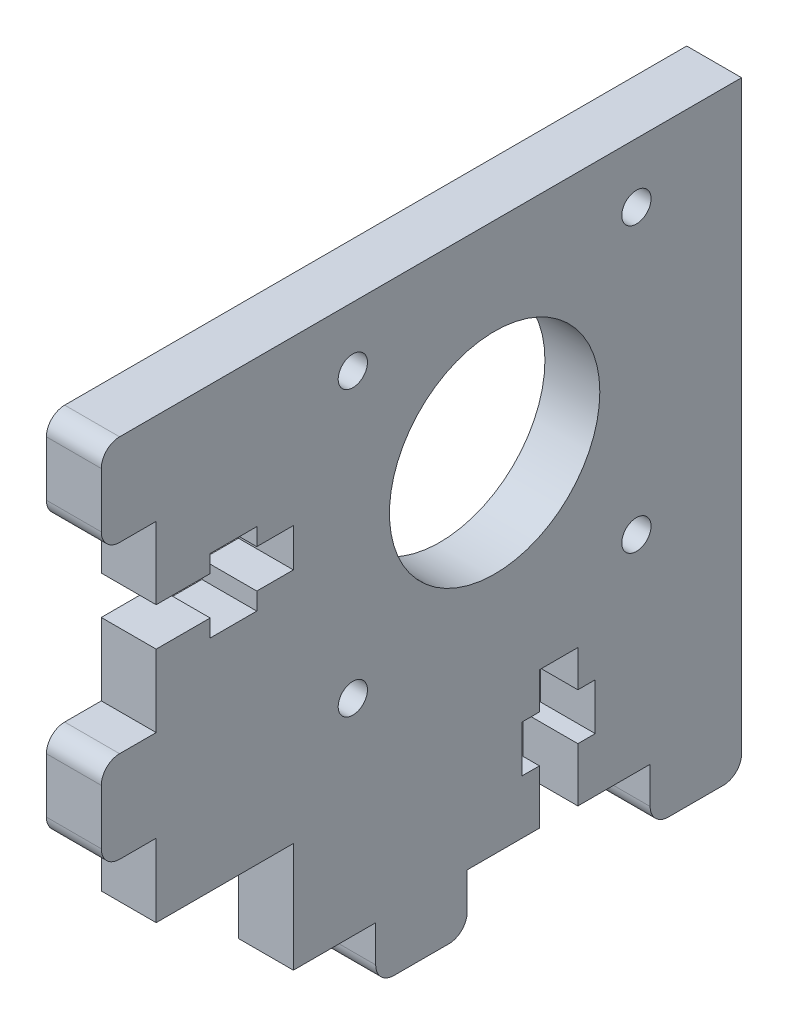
ISO-10303-21;
HEADER;
FILE_DESCRIPTION(('STEP AP214'),'2;1');
FILE_NAME('part.step','',(''),(''),'','','');
FILE_SCHEMA(('AUTOMOTIVE_DESIGN { 1 0 10303 214 1 1 1 1 }'));
ENDSEC;
DATA;
#1=APPLICATION_CONTEXT('core data for automotive mechanical design processes');
#2=APPLICATION_PROTOCOL_DEFINITION('international standard','automotive_design',2000,#1);
#3=PRODUCT_CONTEXT('',#1,'mechanical');
#4=PRODUCT('Part','Part','',(#3));
#5=PRODUCT_RELATED_PRODUCT_CATEGORY('part','',(#4));
#6=PRODUCT_DEFINITION_FORMATION('','',#4);
#7=PRODUCT_DEFINITION_CONTEXT('part definition',#1,'design');
#8=PRODUCT_DEFINITION('design','',#6,#7);
#9=PRODUCT_DEFINITION_SHAPE('','',#8);
#10=(LENGTH_UNIT() NAMED_UNIT(*) SI_UNIT(.MILLI.,.METRE.));
#11=(NAMED_UNIT(*) PLANE_ANGLE_UNIT() SI_UNIT($,.RADIAN.));
#12=(NAMED_UNIT(*) SI_UNIT($,.STERADIAN.) SOLID_ANGLE_UNIT());
#13=UNCERTAINTY_MEASURE_WITH_UNIT(LENGTH_MEASURE(1.E-05),#10,'distance_accuracy_value','');
#14=(GEOMETRIC_REPRESENTATION_CONTEXT(3) GLOBAL_UNCERTAINTY_ASSIGNED_CONTEXT((#13)) GLOBAL_UNIT_ASSIGNED_CONTEXT((#10,
#11,#12)) REPRESENTATION_CONTEXT('',''));
#15=CARTESIAN_POINT('',(0.,0.,0.));
#16=DIRECTION('',(0.,0.,1.));
#17=DIRECTION('',(1.,0.,0.));
#18=AXIS2_PLACEMENT_3D('',#15,#16,#17);
#19=CARTESIAN_POINT('',(6.,60.,-1.04083408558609E-13));
#20=DIRECTION('',(0.,-1.,0.));
#21=DIRECTION('',(0.,0.,-1.));
#22=AXIS2_PLACEMENT_3D('',#19,#20,#21);
#23=PLANE('',#22);
#24=DIRECTION('',(0.,0.,1.));
#25=VECTOR('',#24,1.);
#26=CARTESIAN_POINT('',(0.,60.,-1.04083408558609E-13));
#27=LINE('',#26,#25);
#28=CARTESIAN_POINT('',(0.,60.,-64.0000000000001));
#29=VERTEX_POINT('',#28);
#30=CARTESIAN_POINT('',(0.,60.,3.99999999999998));
#31=VERTEX_POINT('',#30);
#32=EDGE_CURVE('E395',#29,#31,#27,.T.);
#33=ORIENTED_EDGE('',*,*,#32,.T.);
#34=DIRECTION('',(-1.,0.,0.));
#35=VECTOR('',#34,1.);
#36=CARTESIAN_POINT('',(6.,60.,3.99999999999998));
#37=LINE('',#36,#35);
#38=CARTESIAN_POINT('',(6.,60.,3.99999999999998));
#39=VERTEX_POINT('',#38);
#40=EDGE_CURVE('E11',#39,#31,#37,.T.);
#41=ORIENTED_EDGE('',*,*,#40,.F.);
#42=DIRECTION('',(0.,0.,1.));
#43=VECTOR('',#42,1.);
#44=CARTESIAN_POINT('',(6.,60.,-1.04083408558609E-13));
#45=LINE('',#44,#43);
#46=CARTESIAN_POINT('',(6.,60.,-64.0000000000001));
#47=VERTEX_POINT('',#46);
#48=EDGE_CURVE('E516',#47,#39,#45,.T.);
#49=ORIENTED_EDGE('',*,*,#48,.F.);
#50=DIRECTION('',(-1.,0.,0.));
#51=VECTOR('',#50,1.);
#52=CARTESIAN_POINT('',(6.,60.,-64.0000000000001));
#53=LINE('',#52,#51);
#54=EDGE_CURVE('E394',#47,#29,#53,.T.);
#55=ORIENTED_EDGE('',*,*,#54,.T.);
#56=EDGE_LOOP('',(#33,#41,#49,#55));
#57=FACE_BOUND('',#56,.T.);
#58=ADVANCED_FACE('F37',(#57),#23,.F.);
#59=CARTESIAN_POINT('',(6.,58.,4.));
#60=DIRECTION('',(-1.,0.,0.));
#61=DIRECTION('',(0.,0.,1.));
#62=AXIS2_PLACEMENT_3D('',#59,#60,#61);
#63=CYLINDRICAL_SURFACE('',#62,2.);
#64=CARTESIAN_POINT('',(0.,58.,4.));
#65=DIRECTION('',(1.,0.,0.));
#66=DIRECTION('',(0.,0.,-1.));
#67=AXIS2_PLACEMENT_3D('',#64,#65,#66);
#68=CIRCLE('',#67,2.);
#69=CARTESIAN_POINT('',(0.,58.,6.));
#70=VERTEX_POINT('',#69);
#71=EDGE_CURVE('E398',#31,#70,#68,.T.);
#72=ORIENTED_EDGE('',*,*,#71,.T.);
#73=DIRECTION('',(-1.,0.,0.));
#74=VECTOR('',#73,1.);
#75=CARTESIAN_POINT('',(6.,58.,6.));
#76=LINE('',#75,#74);
#77=CARTESIAN_POINT('',(6.,58.,6.));
#78=VERTEX_POINT('',#77);
#79=EDGE_CURVE('E44',#78,#70,#76,.T.);
#80=ORIENTED_EDGE('',*,*,#79,.F.);
#81=CARTESIAN_POINT('',(6.,58.,4.));
#82=DIRECTION('',(1.,0.,0.));
#83=DIRECTION('',(0.,0.,-1.));
#84=AXIS2_PLACEMENT_3D('',#81,#82,#83);
#85=CIRCLE('',#84,2.);
#86=EDGE_CURVE('E218',#39,#78,#85,.T.);
#87=ORIENTED_EDGE('',*,*,#86,.F.);
#88=ORIENTED_EDGE('',*,*,#40,.T.);
#89=EDGE_LOOP('',(#72,#80,#87,#88));
#90=FACE_BOUND('',#89,.T.);
#91=ADVANCED_FACE('F742',(#90),#63,.T.);
#92=CARTESIAN_POINT('',(6.,0.,5.99999999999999));
#93=DIRECTION('',(0.,0.,-1.));
#94=DIRECTION('',(0.,1.,0.));
#95=AXIS2_PLACEMENT_3D('',#92,#93,#94);
#96=PLANE('',#95);
#97=DIRECTION('',(0.,-1.,0.));
#98=VECTOR('',#97,1.);
#99=CARTESIAN_POINT('',(0.,0.,5.99999999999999));
#100=LINE('',#99,#98);
#101=CARTESIAN_POINT('',(0.,52.,6.));
#102=VERTEX_POINT('',#101);
#103=EDGE_CURVE('E401',#70,#102,#100,.T.);
#104=ORIENTED_EDGE('',*,*,#103,.T.);
#105=DIRECTION('',(-1.,0.,0.));
#106=VECTOR('',#105,1.);
#107=CARTESIAN_POINT('',(6.,52.,6.));
#108=LINE('',#107,#106);
#109=CARTESIAN_POINT('',(6.,52.,6.));
#110=VERTEX_POINT('',#109);
#111=EDGE_CURVE('E615',#110,#102,#108,.T.);
#112=ORIENTED_EDGE('',*,*,#111,.F.);
#113=DIRECTION('',(0.,-1.,0.));
#114=VECTOR('',#113,1.);
#115=CARTESIAN_POINT('',(6.,0.,5.99999999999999));
#116=LINE('',#115,#114);
#117=EDGE_CURVE('E622',#78,#110,#116,.T.);
#118=ORIENTED_EDGE('',*,*,#117,.F.);
#119=ORIENTED_EDGE('',*,*,#79,.T.);
#120=EDGE_LOOP('',(#104,#112,#118,#119));
#121=FACE_BOUND('',#120,.T.);
#122=ADVANCED_FACE('F620',(#121),#96,.F.);
#123=CARTESIAN_POINT('',(6.,52.,4.));
#124=DIRECTION('',(-1.,0.,0.));
#125=DIRECTION('',(0.,0.,1.));
#126=AXIS2_PLACEMENT_3D('',#123,#124,#125);
#127=CYLINDRICAL_SURFACE('',#126,2.);
#128=CARTESIAN_POINT('',(0.,52.,4.));
#129=DIRECTION('',(1.,0.,0.));
#130=DIRECTION('',(0.,0.,-1.));
#131=AXIS2_PLACEMENT_3D('',#128,#129,#130);
#132=CIRCLE('',#131,2.);
#133=CARTESIAN_POINT('',(0.,50.,3.99999999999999));
#134=VERTEX_POINT('',#133);
#135=EDGE_CURVE('E404',#134,#102,#132,.F.);
#136=ORIENTED_EDGE('',*,*,#135,.F.);
#137=DIRECTION('',(-1.,0.,0.));
#138=VECTOR('',#137,1.);
#139=CARTESIAN_POINT('',(6.,50.,3.99999999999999));
#140=LINE('',#139,#138);
#141=CARTESIAN_POINT('',(6.,50.,3.99999999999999));
#142=VERTEX_POINT('',#141);
#143=EDGE_CURVE('E613',#142,#134,#140,.T.);
#144=ORIENTED_EDGE('',*,*,#143,.F.);
#145=CARTESIAN_POINT('',(6.,52.,4.));
#146=DIRECTION('',(1.,0.,0.));
#147=DIRECTION('',(0.,0.,-1.));
#148=AXIS2_PLACEMENT_3D('',#145,#146,#147);
#149=CIRCLE('',#148,2.);
#150=EDGE_CURVE('E634',#142,#110,#149,.F.);
#151=ORIENTED_EDGE('',*,*,#150,.T.);
#152=ORIENTED_EDGE('',*,*,#111,.T.);
#153=EDGE_LOOP('',(#136,#144,#151,#152));
#154=FACE_BOUND('',#153,.T.);
#155=ADVANCED_FACE('F631',(#154),#127,.T.);
#156=CARTESIAN_POINT('',(6.,50.,0.));
#157=DIRECTION('',(0.,-1.,0.));
#158=DIRECTION('',(0.,0.,-1.));
#159=AXIS2_PLACEMENT_3D('',#156,#157,#158);
#160=PLANE('',#159);
#161=DIRECTION('',(0.,0.,1.));
#162=VECTOR('',#161,1.);
#163=CARTESIAN_POINT('',(0.,50.,0.));
#164=LINE('',#163,#162);
#165=CARTESIAN_POINT('',(0.,50.,0.));
#166=VERTEX_POINT('',#165);
#167=EDGE_CURVE('E407',#166,#134,#164,.T.);
#168=ORIENTED_EDGE('',*,*,#167,.F.);
#169=DIRECTION('',(-1.,0.,0.));
#170=VECTOR('',#169,1.);
#171=CARTESIAN_POINT('',(6.,50.,0.));
#172=LINE('',#171,#170);
#173=CARTESIAN_POINT('',(6.,50.,0.));
#174=VERTEX_POINT('',#173);
#175=EDGE_CURVE('E611',#174,#166,#172,.T.);
#176=ORIENTED_EDGE('',*,*,#175,.F.);
#177=DIRECTION('',(0.,0.,1.));
#178=VECTOR('',#177,1.);
#179=CARTESIAN_POINT('',(6.,50.,0.));
#180=LINE('',#179,#178);
#181=EDGE_CURVE('E637',#174,#142,#180,.T.);
#182=ORIENTED_EDGE('',*,*,#181,.T.);
#183=ORIENTED_EDGE('',*,*,#143,.T.);
#184=EDGE_LOOP('',(#168,#176,#182,#183));
#185=FACE_BOUND('',#184,.T.);
#186=ADVANCED_FACE('F753',(#185),#160,.T.);
#187=CARTESIAN_POINT('',(6.,0.,0.));
#188=DIRECTION('',(0.,0.,1.));
#189=DIRECTION('',(1.,0.,0.));
#190=AXIS2_PLACEMENT_3D('',#187,#188,#189);
#191=PLANE('',#190);
#192=DIRECTION('',(0.,1.,0.));
#193=VECTOR('',#192,1.);
#194=CARTESIAN_POINT('',(0.,0.,0.));
#195=LINE('',#194,#193);
#196=CARTESIAN_POINT('',(0.,42.1,0.));
#197=VERTEX_POINT('',#196);
#198=EDGE_CURVE('E410',#197,#166,#195,.T.);
#199=ORIENTED_EDGE('',*,*,#198,.F.);
#200=DIRECTION('',(-1.,0.,0.));
#201=VECTOR('',#200,1.);
#202=CARTESIAN_POINT('',(6.,42.1,0.));
#203=LINE('',#202,#201);
#204=CARTESIAN_POINT('',(6.,42.1,0.));
#205=VERTEX_POINT('',#204);
#206=EDGE_CURVE('E609',#205,#197,#203,.T.);
#207=ORIENTED_EDGE('',*,*,#206,.F.);
#208=DIRECTION('',(0.,1.,0.));
#209=VECTOR('',#208,1.);
#210=CARTESIAN_POINT('',(6.,0.,0.));
#211=LINE('',#210,#209);
#212=EDGE_CURVE('E639',#205,#174,#211,.T.);
#213=ORIENTED_EDGE('',*,*,#212,.T.);
#214=ORIENTED_EDGE('',*,*,#175,.T.);
#215=EDGE_LOOP('',(#199,#207,#213,#214));
#216=FACE_BOUND('',#215,.T.);
#217=ADVANCED_FACE('F756',(#216),#191,.T.);
#218=CARTESIAN_POINT('',(6.,42.1,0.));
#219=DIRECTION('',(0.,1.,0.));
#220=DIRECTION('',(0.,0.,1.));
#221=AXIS2_PLACEMENT_3D('',#218,#219,#220);
#222=PLANE('',#221);
#223=DIRECTION('',(0.,0.,-1.));
#224=VECTOR('',#223,1.);
#225=CARTESIAN_POINT('',(0.,42.1,0.));
#226=LINE('',#225,#224);
#227=CARTESIAN_POINT('',(0.,42.1,-5.90000000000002));
#228=VERTEX_POINT('',#227);
#229=EDGE_CURVE('E413',#197,#228,#226,.T.);
#230=ORIENTED_EDGE('',*,*,#229,.T.);
#231=DIRECTION('',(-1.,0.,0.));
#232=VECTOR('',#231,1.);
#233=CARTESIAN_POINT('',(6.,42.1,-5.90000000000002));
#234=LINE('',#233,#232);
#235=CARTESIAN_POINT('',(6.,42.1,-5.90000000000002));
#236=VERTEX_POINT('',#235);
#237=EDGE_CURVE('E607',#236,#228,#234,.T.);
#238=ORIENTED_EDGE('',*,*,#237,.F.);
#239=DIRECTION('',(0.,0.,-1.));
#240=VECTOR('',#239,1.);
#241=CARTESIAN_POINT('',(6.,42.1,0.));
#242=LINE('',#241,#240);
#243=EDGE_CURVE('E646',#205,#236,#242,.T.);
#244=ORIENTED_EDGE('',*,*,#243,.F.);
#245=ORIENTED_EDGE('',*,*,#206,.T.);
#246=EDGE_LOOP('',(#230,#238,#244,#245));
#247=FACE_BOUND('',#246,.T.);
#248=ADVANCED_FACE('F769',(#247),#222,.F.);
#249=CARTESIAN_POINT('',(6.,0.,-5.90000000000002));
#250=DIRECTION('',(0.,0.,-1.));
#251=DIRECTION('',(-1.,0.,0.));
#252=AXIS2_PLACEMENT_3D('',#249,#250,#251);
#253=PLANE('',#252);
#254=DIRECTION('',(0.,-1.,0.));
#255=VECTOR('',#254,1.);
#256=CARTESIAN_POINT('',(0.,0.,-5.90000000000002));
#257=LINE('',#256,#255);
#258=CARTESIAN_POINT('',(0.,44.,-5.90000000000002));
#259=VERTEX_POINT('',#258);
#260=EDGE_CURVE('E418',#259,#228,#257,.T.);
#261=ORIENTED_EDGE('',*,*,#260,.F.);
#262=DIRECTION('',(-1.,0.,0.));
#263=VECTOR('',#262,1.);
#264=CARTESIAN_POINT('',(6.,44.,-5.90000000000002));
#265=LINE('',#264,#263);
#266=CARTESIAN_POINT('',(6.,44.,-5.90000000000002));
#267=VERTEX_POINT('',#266);
#268=EDGE_CURVE('E605',#267,#259,#265,.T.);
#269=ORIENTED_EDGE('',*,*,#268,.F.);
#270=DIRECTION('',(0.,-1.,0.));
#271=VECTOR('',#270,1.);
#272=CARTESIAN_POINT('',(6.,0.,-5.90000000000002));
#273=LINE('',#272,#271);
#274=EDGE_CURVE('E650',#267,#236,#273,.T.);
#275=ORIENTED_EDGE('',*,*,#274,.T.);
#276=ORIENTED_EDGE('',*,*,#237,.T.);
#277=EDGE_LOOP('',(#261,#269,#275,#276));
#278=FACE_BOUND('',#277,.T.);
#279=ADVANCED_FACE('F762',(#278),#253,.T.);
#280=CARTESIAN_POINT('',(6.,44.,0.));
#281=DIRECTION('',(0.,1.,0.));
#282=DIRECTION('',(0.,0.,1.));
#283=AXIS2_PLACEMENT_3D('',#280,#281,#282);
#284=PLANE('',#283);
#285=DIRECTION('',(0.,0.,-1.));
#286=VECTOR('',#285,1.);
#287=CARTESIAN_POINT('',(0.,44.,0.));
#288=LINE('',#287,#286);
#289=CARTESIAN_POINT('',(0.,44.,-11.));
#290=VERTEX_POINT('',#289);
#291=EDGE_CURVE('E422',#259,#290,#288,.T.);
#292=ORIENTED_EDGE('',*,*,#291,.T.);
#293=DIRECTION('',(-1.,0.,0.));
#294=VECTOR('',#293,1.);
#295=CARTESIAN_POINT('',(6.,44.,-11.));
#296=LINE('',#295,#294);
#297=CARTESIAN_POINT('',(6.,44.,-11.));
#298=VERTEX_POINT('',#297);
#299=EDGE_CURVE('E602',#298,#290,#296,.T.);
#300=ORIENTED_EDGE('',*,*,#299,.F.);
#301=DIRECTION('',(0.,0.,-1.));
#302=VECTOR('',#301,1.);
#303=CARTESIAN_POINT('',(6.,44.,0.));
#304=LINE('',#303,#302);
#305=EDGE_CURVE('E654',#267,#298,#304,.T.);
#306=ORIENTED_EDGE('',*,*,#305,.F.);
#307=ORIENTED_EDGE('',*,*,#268,.T.);
#308=EDGE_LOOP('',(#292,#300,#306,#307));
#309=FACE_BOUND('',#308,.T.);
#310=ADVANCED_FACE('F758',(#309),#284,.F.);
#311=CARTESIAN_POINT('',(6.,0.,-11.));
#312=DIRECTION('',(0.,0.,-1.));
#313=DIRECTION('',(-1.,0.,0.));
#314=AXIS2_PLACEMENT_3D('',#311,#312,#313);
#315=PLANE('',#314);
#316=DIRECTION('',(0.,-1.,0.));
#317=VECTOR('',#316,1.);
#318=CARTESIAN_POINT('',(0.,0.,-11.));
#319=LINE('',#318,#317);
#320=CARTESIAN_POINT('',(0.,42.1,-11.));
#321=VERTEX_POINT('',#320);
#322=EDGE_CURVE('E425',#290,#321,#319,.T.);
#323=ORIENTED_EDGE('',*,*,#322,.T.);
#324=DIRECTION('',(-1.,0.,0.));
#325=VECTOR('',#324,1.);
#326=CARTESIAN_POINT('',(6.,42.1,-11.));
#327=LINE('',#326,#325);
#328=CARTESIAN_POINT('',(6.,42.1,-11.));
#329=VERTEX_POINT('',#328);
#330=EDGE_CURVE('E599',#329,#321,#327,.T.);
#331=ORIENTED_EDGE('',*,*,#330,.F.);
#332=DIRECTION('',(0.,-1.,0.));
#333=VECTOR('',#332,1.);
#334=CARTESIAN_POINT('',(6.,0.,-11.));
#335=LINE('',#334,#333);
#336=EDGE_CURVE('E657',#298,#329,#335,.T.);
#337=ORIENTED_EDGE('',*,*,#336,.F.);
#338=ORIENTED_EDGE('',*,*,#299,.T.);
#339=EDGE_LOOP('',(#323,#331,#337,#338));
#340=FACE_BOUND('',#339,.T.);
#341=ADVANCED_FACE('F761',(#340),#315,.F.);
#342=CARTESIAN_POINT('',(0.,42.1,-15.));
#343=VERTEX_POINT('',#342);
#344=EDGE_CURVE('E419',#321,#343,#226,.T.);
#345=ORIENTED_EDGE('',*,*,#344,.T.);
#346=DIRECTION('',(-1.,0.,0.));
#347=VECTOR('',#346,1.);
#348=CARTESIAN_POINT('',(6.,42.1,-15.));
#349=LINE('',#348,#347);
#350=CARTESIAN_POINT('',(6.,42.1,-15.));
#351=VERTEX_POINT('',#350);
#352=EDGE_CURVE('E596',#351,#343,#349,.T.);
#353=ORIENTED_EDGE('',*,*,#352,.F.);
#354=EDGE_CURVE('E651',#329,#351,#242,.T.);
#355=ORIENTED_EDGE('',*,*,#354,.F.);
#356=ORIENTED_EDGE('',*,*,#330,.T.);
#357=EDGE_LOOP('',(#345,#353,#355,#356));
#358=FACE_BOUND('',#357,.T.);
#359=ADVANCED_FACE('F764',(#358),#222,.F.);
#360=CARTESIAN_POINT('',(6.,0.,-15.0000000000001));
#361=DIRECTION('',(0.,0.,-1.));
#362=DIRECTION('',(0.,1.,0.));
#363=AXIS2_PLACEMENT_3D('',#360,#361,#362);
#364=PLANE('',#363);
#365=DIRECTION('',(0.,-1.,0.));
#366=VECTOR('',#365,1.);
#367=CARTESIAN_POINT('',(0.,0.,-15.0000000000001));
#368=LINE('',#367,#366);
#369=CARTESIAN_POINT('',(0.,37.9,-15.));
#370=VERTEX_POINT('',#369);
#371=EDGE_CURVE('E428',#343,#370,#368,.T.);
#372=ORIENTED_EDGE('',*,*,#371,.T.);
#373=DIRECTION('',(-1.,0.,0.));
#374=VECTOR('',#373,1.);
#375=CARTESIAN_POINT('',(6.,37.9,-15.));
#376=LINE('',#375,#374);
#377=CARTESIAN_POINT('',(6.,37.9,-15.));
#378=VERTEX_POINT('',#377);
#379=EDGE_CURVE('E594',#378,#370,#376,.T.);
#380=ORIENTED_EDGE('',*,*,#379,.F.);
#381=DIRECTION('',(0.,-1.,0.));
#382=VECTOR('',#381,1.);
#383=CARTESIAN_POINT('',(6.,0.,-15.0000000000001));
#384=LINE('',#383,#382);
#385=EDGE_CURVE('E660',#351,#378,#384,.T.);
#386=ORIENTED_EDGE('',*,*,#385,.F.);
#387=ORIENTED_EDGE('',*,*,#352,.T.);
#388=EDGE_LOOP('',(#372,#380,#386,#387));
#389=FACE_BOUND('',#388,.T.);
#390=ADVANCED_FACE('F767',(#389),#364,.F.);
#391=CARTESIAN_POINT('',(6.,37.9,0.));
#392=DIRECTION('',(0.,1.,0.));
#393=DIRECTION('',(0.,0.,1.));
#394=AXIS2_PLACEMENT_3D('',#391,#392,#393);
#395=PLANE('',#394);
#396=DIRECTION('',(0.,0.,-1.));
#397=VECTOR('',#396,1.);
#398=CARTESIAN_POINT('',(0.,37.9,0.));
#399=LINE('',#398,#397);
#400=CARTESIAN_POINT('',(0.,37.9,-11.));
#401=VERTEX_POINT('',#400);
#402=EDGE_CURVE('E431',#401,#370,#399,.T.);
#403=ORIENTED_EDGE('',*,*,#402,.F.);
#404=DIRECTION('',(-1.,0.,0.));
#405=VECTOR('',#404,1.);
#406=CARTESIAN_POINT('',(6.,37.9,-11.));
#407=LINE('',#406,#405);
#408=CARTESIAN_POINT('',(6.,37.9,-11.));
#409=VERTEX_POINT('',#408);
#410=EDGE_CURVE('E592',#409,#401,#407,.T.);
#411=ORIENTED_EDGE('',*,*,#410,.F.);
#412=DIRECTION('',(0.,0.,-1.));
#413=VECTOR('',#412,1.);
#414=CARTESIAN_POINT('',(6.,37.9,0.));
#415=LINE('',#414,#413);
#416=EDGE_CURVE('E662',#409,#378,#415,.T.);
#417=ORIENTED_EDGE('',*,*,#416,.T.);
#418=ORIENTED_EDGE('',*,*,#379,.T.);
#419=EDGE_LOOP('',(#403,#411,#417,#418));
#420=FACE_BOUND('',#419,.T.);
#421=ADVANCED_FACE('F772',(#420),#395,.T.);
#422=CARTESIAN_POINT('',(0.,36.,-11.));
#423=VERTEX_POINT('',#422);
#424=EDGE_CURVE('E427',#401,#423,#319,.T.);
#425=ORIENTED_EDGE('',*,*,#424,.T.);
#426=DIRECTION('',(-1.,0.,0.));
#427=VECTOR('',#426,1.);
#428=CARTESIAN_POINT('',(6.,36.,-11.));
#429=LINE('',#428,#427);
#430=CARTESIAN_POINT('',(6.,36.,-11.));
#431=VERTEX_POINT('',#430);
#432=EDGE_CURVE('E590',#431,#423,#429,.T.);
#433=ORIENTED_EDGE('',*,*,#432,.F.);
#434=EDGE_CURVE('E659',#409,#431,#335,.T.);
#435=ORIENTED_EDGE('',*,*,#434,.F.);
#436=ORIENTED_EDGE('',*,*,#410,.T.);
#437=EDGE_LOOP('',(#425,#433,#435,#436));
#438=FACE_BOUND('',#437,.T.);
#439=ADVANCED_FACE('F774',(#438),#315,.F.);
#440=CARTESIAN_POINT('',(6.,36.,0.));
#441=DIRECTION('',(0.,1.,0.));
#442=DIRECTION('',(0.,0.,1.));
#443=AXIS2_PLACEMENT_3D('',#440,#441,#442);
#444=PLANE('',#443);
#445=DIRECTION('',(0.,0.,-1.));
#446=VECTOR('',#445,1.);
#447=CARTESIAN_POINT('',(0.,36.,0.));
#448=LINE('',#447,#446);
#449=CARTESIAN_POINT('',(0.,36.,-5.90000000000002));
#450=VERTEX_POINT('',#449);
#451=EDGE_CURVE('E435',#450,#423,#448,.T.);
#452=ORIENTED_EDGE('',*,*,#451,.F.);
#453=DIRECTION('',(-1.,0.,0.));
#454=VECTOR('',#453,1.);
#455=CARTESIAN_POINT('',(6.,36.,-5.90000000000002));
#456=LINE('',#455,#454);
#457=CARTESIAN_POINT('',(6.,36.,-5.90000000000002));
#458=VERTEX_POINT('',#457);
#459=EDGE_CURVE('E588',#458,#450,#456,.T.);
#460=ORIENTED_EDGE('',*,*,#459,.F.);
#461=DIRECTION('',(0.,0.,-1.));
#462=VECTOR('',#461,1.);
#463=CARTESIAN_POINT('',(6.,36.,0.));
#464=LINE('',#463,#462);
#465=EDGE_CURVE('E666',#458,#431,#464,.T.);
#466=ORIENTED_EDGE('',*,*,#465,.T.);
#467=ORIENTED_EDGE('',*,*,#432,.T.);
#468=EDGE_LOOP('',(#452,#460,#466,#467));
#469=FACE_BOUND('',#468,.T.);
#470=ADVANCED_FACE('F777',(#469),#444,.T.);
#471=CARTESIAN_POINT('',(0.,37.9,-5.90000000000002));
#472=VERTEX_POINT('',#471);
#473=EDGE_CURVE('E423',#472,#450,#257,.T.);
#474=ORIENTED_EDGE('',*,*,#473,.F.);
#475=DIRECTION('',(-1.,0.,0.));
#476=VECTOR('',#475,1.);
#477=CARTESIAN_POINT('',(6.,37.9,-5.90000000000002));
#478=LINE('',#477,#476);
#479=CARTESIAN_POINT('',(6.,37.9,-5.90000000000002));
#480=VERTEX_POINT('',#479);
#481=EDGE_CURVE('E586',#480,#472,#478,.T.);
#482=ORIENTED_EDGE('',*,*,#481,.F.);
#483=EDGE_CURVE('E655',#480,#458,#273,.T.);
#484=ORIENTED_EDGE('',*,*,#483,.T.);
#485=ORIENTED_EDGE('',*,*,#459,.T.);
#486=EDGE_LOOP('',(#474,#482,#484,#485));
#487=FACE_BOUND('',#486,.T.);
#488=ADVANCED_FACE('F781',(#487),#253,.T.);
#489=CARTESIAN_POINT('',(0.,37.9,0.));
#490=VERTEX_POINT('',#489);
#491=EDGE_CURVE('E434',#490,#472,#399,.T.);
#492=ORIENTED_EDGE('',*,*,#491,.F.);
#493=DIRECTION('',(-1.,0.,0.));
#494=VECTOR('',#493,1.);
#495=CARTESIAN_POINT('',(6.,37.9,0.));
#496=LINE('',#495,#494);
#497=CARTESIAN_POINT('',(6.,37.9,0.));
#498=VERTEX_POINT('',#497);
#499=EDGE_CURVE('E584',#498,#490,#496,.T.);
#500=ORIENTED_EDGE('',*,*,#499,.F.);
#501=EDGE_CURVE('E665',#498,#480,#415,.T.);
#502=ORIENTED_EDGE('',*,*,#501,.T.);
#503=ORIENTED_EDGE('',*,*,#481,.T.);
#504=EDGE_LOOP('',(#492,#500,#502,#503));
#505=FACE_BOUND('',#504,.T.);
#506=ADVANCED_FACE('F785',(#505),#395,.T.);
#507=CARTESIAN_POINT('',(0.,30.,0.));
#508=VERTEX_POINT('',#507);
#509=EDGE_CURVE('E415',#508,#490,#195,.T.);
#510=ORIENTED_EDGE('',*,*,#509,.F.);
#511=DIRECTION('',(-1.,0.,0.));
#512=VECTOR('',#511,1.);
#513=CARTESIAN_POINT('',(6.,30.,0.));
#514=LINE('',#513,#512);
#515=CARTESIAN_POINT('',(6.,30.,0.));
#516=VERTEX_POINT('',#515);
#517=EDGE_CURVE('E582',#516,#508,#514,.T.);
#518=ORIENTED_EDGE('',*,*,#517,.F.);
#519=EDGE_CURVE('E648',#516,#498,#211,.T.);
#520=ORIENTED_EDGE('',*,*,#519,.T.);
#521=ORIENTED_EDGE('',*,*,#499,.T.);
#522=EDGE_LOOP('',(#510,#518,#520,#521));
#523=FACE_BOUND('',#522,.T.);
#524=ADVANCED_FACE('F789',(#523),#191,.T.);
#525=CARTESIAN_POINT('',(6.,30.,0.));
#526=DIRECTION('',(0.,-1.,0.));
#527=DIRECTION('',(0.,0.,-1.));
#528=AXIS2_PLACEMENT_3D('',#525,#526,#527);
#529=PLANE('',#528);
#530=DIRECTION('',(0.,0.,1.));
#531=VECTOR('',#530,1.);
#532=CARTESIAN_POINT('',(0.,30.,0.));
#533=LINE('',#532,#531);
#534=CARTESIAN_POINT('',(0.,30.,3.99999999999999));
#535=VERTEX_POINT('',#534);
#536=EDGE_CURVE('E438',#508,#535,#533,.T.);
#537=ORIENTED_EDGE('',*,*,#536,.T.);
#538=DIRECTION('',(-1.,0.,0.));
#539=VECTOR('',#538,1.);
#540=CARTESIAN_POINT('',(6.,30.,3.99999999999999));
#541=LINE('',#540,#539);
#542=CARTESIAN_POINT('',(6.,30.,3.99999999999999));
#543=VERTEX_POINT('',#542);
#544=EDGE_CURVE('E579',#543,#535,#541,.T.);
#545=ORIENTED_EDGE('',*,*,#544,.F.);
#546=DIRECTION('',(0.,0.,1.));
#547=VECTOR('',#546,1.);
#548=CARTESIAN_POINT('',(6.,30.,0.));
#549=LINE('',#548,#547);
#550=EDGE_CURVE('E669',#516,#543,#549,.T.);
#551=ORIENTED_EDGE('',*,*,#550,.F.);
#552=ORIENTED_EDGE('',*,*,#517,.T.);
#553=EDGE_LOOP('',(#537,#545,#551,#552));
#554=FACE_BOUND('',#553,.T.);
#555=ADVANCED_FACE('F791',(#554),#529,.F.);
#556=CARTESIAN_POINT('',(6.,28.,4.));
#557=DIRECTION('',(-1.,0.,0.));
#558=DIRECTION('',(0.,0.,1.));
#559=AXIS2_PLACEMENT_3D('',#556,#557,#558);
#560=CYLINDRICAL_SURFACE('',#559,2.);
#561=CARTESIAN_POINT('',(0.,28.,4.));
#562=DIRECTION('',(1.,0.,0.));
#563=DIRECTION('',(0.,0.,-1.));
#564=AXIS2_PLACEMENT_3D('',#561,#562,#563);
#565=CIRCLE('',#564,2.);
#566=CARTESIAN_POINT('',(0.,28.,6.));
#567=VERTEX_POINT('',#566);
#568=EDGE_CURVE('E440',#535,#567,#565,.T.);
#569=ORIENTED_EDGE('',*,*,#568,.T.);
#570=DIRECTION('',(-1.,0.,0.));
#571=VECTOR('',#570,1.);
#572=CARTESIAN_POINT('',(6.,28.,6.));
#573=LINE('',#572,#571);
#574=CARTESIAN_POINT('',(6.,28.,6.));
#575=VERTEX_POINT('',#574);
#576=EDGE_CURVE('E576',#575,#567,#573,.T.);
#577=ORIENTED_EDGE('',*,*,#576,.F.);
#578=CARTESIAN_POINT('',(6.,28.,4.));
#579=DIRECTION('',(1.,0.,0.));
#580=DIRECTION('',(0.,0.,-1.));
#581=AXIS2_PLACEMENT_3D('',#578,#579,#580);
#582=CIRCLE('',#581,2.);
#583=EDGE_CURVE('E671',#543,#575,#582,.T.);
#584=ORIENTED_EDGE('',*,*,#583,.F.);
#585=ORIENTED_EDGE('',*,*,#544,.T.);
#586=EDGE_LOOP('',(#569,#577,#584,#585));
#587=FACE_BOUND('',#586,.T.);
#588=ADVANCED_FACE('F794',(#587),#560,.T.);
#589=CARTESIAN_POINT('',(6.,0.,6.));
#590=DIRECTION('',(0.,0.,-1.));
#591=DIRECTION('',(0.,1.,0.));
#592=AXIS2_PLACEMENT_3D('',#589,#590,#591);
#593=PLANE('',#592);
#594=DIRECTION('',(0.,-1.,0.));
#595=VECTOR('',#594,1.);
#596=CARTESIAN_POINT('',(0.,0.,6.));
#597=LINE('',#596,#595);
#598=CARTESIAN_POINT('',(0.,22.,6.));
#599=VERTEX_POINT('',#598);
#600=EDGE_CURVE('E442',#567,#599,#597,.T.);
#601=ORIENTED_EDGE('',*,*,#600,.T.);
#602=DIRECTION('',(-1.,0.,0.));
#603=VECTOR('',#602,1.);
#604=CARTESIAN_POINT('',(6.,22.,6.));
#605=LINE('',#604,#603);
#606=CARTESIAN_POINT('',(6.,22.,6.));
#607=VERTEX_POINT('',#606);
#608=EDGE_CURVE('E574',#607,#599,#605,.T.);
#609=ORIENTED_EDGE('',*,*,#608,.F.);
#610=DIRECTION('',(0.,-1.,0.));
#611=VECTOR('',#610,1.);
#612=CARTESIAN_POINT('',(6.,0.,6.));
#613=LINE('',#612,#611);
#614=EDGE_CURVE('E673',#575,#607,#613,.T.);
#615=ORIENTED_EDGE('',*,*,#614,.F.);
#616=ORIENTED_EDGE('',*,*,#576,.T.);
#617=EDGE_LOOP('',(#601,#609,#615,#616));
#618=FACE_BOUND('',#617,.T.);
#619=ADVANCED_FACE('F798',(#618),#593,.F.);
#620=CARTESIAN_POINT('',(6.,22.,4.));
#621=DIRECTION('',(-1.,0.,0.));
#622=DIRECTION('',(0.,0.,1.));
#623=AXIS2_PLACEMENT_3D('',#620,#621,#622);
#624=CYLINDRICAL_SURFACE('',#623,2.);
#625=CARTESIAN_POINT('',(0.,22.,4.));
#626=DIRECTION('',(1.,0.,0.));
#627=DIRECTION('',(0.,0.,-1.));
#628=AXIS2_PLACEMENT_3D('',#625,#626,#627);
#629=CIRCLE('',#628,2.);
#630=CARTESIAN_POINT('',(0.,20.,3.99999999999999));
#631=VERTEX_POINT('',#630);
#632=EDGE_CURVE('E445',#631,#599,#629,.F.);
#633=ORIENTED_EDGE('',*,*,#632,.F.);
#634=DIRECTION('',(-1.,0.,0.));
#635=VECTOR('',#634,1.);
#636=CARTESIAN_POINT('',(6.,20.,3.99999999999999));
#637=LINE('',#636,#635);
#638=CARTESIAN_POINT('',(6.,20.,3.99999999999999));
#639=VERTEX_POINT('',#638);
#640=EDGE_CURVE('E572',#639,#631,#637,.T.);
#641=ORIENTED_EDGE('',*,*,#640,.F.);
#642=CARTESIAN_POINT('',(6.,22.,4.));
#643=DIRECTION('',(1.,0.,0.));
#644=DIRECTION('',(0.,0.,-1.));
#645=AXIS2_PLACEMENT_3D('',#642,#643,#644);
#646=CIRCLE('',#645,2.);
#647=EDGE_CURVE('E675',#639,#607,#646,.F.);
#648=ORIENTED_EDGE('',*,*,#647,.T.);
#649=ORIENTED_EDGE('',*,*,#608,.T.);
#650=EDGE_LOOP('',(#633,#641,#648,#649));
#651=FACE_BOUND('',#650,.T.);
#652=ADVANCED_FACE('F802',(#651),#624,.T.);
#653=CARTESIAN_POINT('',(6.,20.,0.));
#654=DIRECTION('',(0.,-1.,0.));
#655=DIRECTION('',(0.,0.,-1.));
#656=AXIS2_PLACEMENT_3D('',#653,#654,#655);
#657=PLANE('',#656);
#658=DIRECTION('',(0.,0.,1.));
#659=VECTOR('',#658,1.);
#660=CARTESIAN_POINT('',(0.,20.,0.));
#661=LINE('',#660,#659);
#662=CARTESIAN_POINT('',(0.,20.,0.));
#663=VERTEX_POINT('',#662);
#664=EDGE_CURVE('E448',#663,#631,#661,.T.);
#665=ORIENTED_EDGE('',*,*,#664,.F.);
#666=DIRECTION('',(-1.,0.,0.));
#667=VECTOR('',#666,1.);
#668=CARTESIAN_POINT('',(6.,20.,0.));
#669=LINE('',#668,#667);
#670=CARTESIAN_POINT('',(6.,20.,0.));
#671=VERTEX_POINT('',#670);
#672=EDGE_CURVE('E569',#671,#663,#669,.T.);
#673=ORIENTED_EDGE('',*,*,#672,.F.);
#674=DIRECTION('',(0.,0.,1.));
#675=VECTOR('',#674,1.);
#676=CARTESIAN_POINT('',(6.,20.,0.));
#677=LINE('',#676,#675);
#678=EDGE_CURVE('E678',#671,#639,#677,.T.);
#679=ORIENTED_EDGE('',*,*,#678,.T.);
#680=ORIENTED_EDGE('',*,*,#640,.T.);
#681=EDGE_LOOP('',(#665,#673,#679,#680));
#682=FACE_BOUND('',#681,.T.);
#683=ADVANCED_FACE('F806',(#682),#657,.T.);
#684=DIRECTION('',(1.,0.,0.));
#685=VECTOR('',#684,1.);
#686=CARTESIAN_POINT('',(0.,12.,0.));
#687=LINE('',#686,#685);
#688=CARTESIAN_POINT('',(0.,12.,0.));
#689=VERTEX_POINT('',#688);
#690=CARTESIAN_POINT('',(6.,12.,0.));
#691=VERTEX_POINT('',#690);
#692=EDGE_CURVE('E399',#689,#691,#687,.T.);
#693=ORIENTED_EDGE('',*,*,#692,.T.);
#694=EDGE_CURVE('E647',#691,#671,#211,.T.);
#695=ORIENTED_EDGE('',*,*,#694,.T.);
#696=ORIENTED_EDGE('',*,*,#672,.T.);
#697=EDGE_CURVE('E414',#689,#663,#195,.T.);
#698=ORIENTED_EDGE('',*,*,#697,.F.);
#699=EDGE_LOOP('',(#693,#695,#696,#698));
#700=FACE_BOUND('',#699,.T.);
#701=ADVANCED_FACE('F810',(#700),#191,.T.);
#702=CARTESIAN_POINT('',(6.,0.,0.));
#703=DIRECTION('',(0.,1.,0.));
#704=DIRECTION('',(0.,0.,1.));
#705=AXIS2_PLACEMENT_3D('',#702,#703,#704);
#706=PLANE('',#705);
#707=DIRECTION('',(0.,0.,-1.));
#708=VECTOR('',#707,1.);
#709=CARTESIAN_POINT('',(6.,0.,0.));
#710=LINE('',#709,#708);
#711=CARTESIAN_POINT('',(6.,0.,-15.));
#712=VERTEX_POINT('',#711);
#713=CARTESIAN_POINT('',(6.,0.,-24.0000000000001));
#714=VERTEX_POINT('',#713);
#715=EDGE_CURVE('E681',#712,#714,#710,.T.);
#716=ORIENTED_EDGE('',*,*,#715,.F.);
#717=DIRECTION('',(1.,0.,0.));
#718=VECTOR('',#717,1.);
#719=CARTESIAN_POINT('',(0.,0.,-15.));
#720=LINE('',#719,#718);
#721=CARTESIAN_POINT('',(0.,0.,-15.));
#722=VERTEX_POINT('',#721);
#723=EDGE_CURVE('E936',#722,#712,#720,.T.);
#724=ORIENTED_EDGE('',*,*,#723,.F.);
#725=DIRECTION('',(0.,0.,-1.));
#726=VECTOR('',#725,1.);
#727=CARTESIAN_POINT('',(0.,0.,0.));
#728=LINE('',#727,#726);
#729=CARTESIAN_POINT('',(0.,0.,-24.0000000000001));
#730=VERTEX_POINT('',#729);
#731=EDGE_CURVE('E451',#722,#730,#728,.T.);
#732=ORIENTED_EDGE('',*,*,#731,.T.);
#733=DIRECTION('',(-1.,0.,0.));
#734=VECTOR('',#733,1.);
#735=CARTESIAN_POINT('',(6.,0.,-24.0000000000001));
#736=LINE('',#735,#734);
#737=EDGE_CURVE('E566',#714,#730,#736,.T.);
#738=ORIENTED_EDGE('',*,*,#737,.F.);
#739=EDGE_LOOP('',(#716,#724,#732,#738));
#740=FACE_BOUND('',#739,.T.);
#741=ADVANCED_FACE('F814',(#740),#706,.F.);
#742=CARTESIAN_POINT('',(6.,0.,-24.0000000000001));
#743=DIRECTION('',(0.,0.,-1.));
#744=DIRECTION('',(-1.,0.,0.));
#745=AXIS2_PLACEMENT_3D('',#742,#743,#744);
#746=PLANE('',#745);
#747=DIRECTION('',(0.,-1.,0.));
#748=VECTOR('',#747,1.);
#749=CARTESIAN_POINT('',(0.,0.,-24.0000000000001));
#750=LINE('',#749,#748);
#751=CARTESIAN_POINT('',(0.,-3.99999999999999,-24.0000000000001));
#752=VERTEX_POINT('',#751);
#753=EDGE_CURVE('E453',#730,#752,#750,.T.);
#754=ORIENTED_EDGE('',*,*,#753,.T.);
#755=DIRECTION('',(-1.,0.,0.));
#756=VECTOR('',#755,1.);
#757=CARTESIAN_POINT('',(6.,-3.99999999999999,-24.0000000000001));
#758=LINE('',#757,#756);
#759=CARTESIAN_POINT('',(6.,-3.99999999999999,-24.0000000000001));
#760=VERTEX_POINT('',#759);
#761=EDGE_CURVE('E563',#760,#752,#758,.T.);
#762=ORIENTED_EDGE('',*,*,#761,.F.);
#763=DIRECTION('',(0.,-1.,0.));
#764=VECTOR('',#763,1.);
#765=CARTESIAN_POINT('',(6.,0.,-24.0000000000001));
#766=LINE('',#765,#764);
#767=EDGE_CURVE('E683',#714,#760,#766,.T.);
#768=ORIENTED_EDGE('',*,*,#767,.F.);
#769=ORIENTED_EDGE('',*,*,#737,.T.);
#770=EDGE_LOOP('',(#754,#762,#768,#769));
#771=FACE_BOUND('',#770,.T.);
#772=ADVANCED_FACE('F816',(#771),#746,.F.);
#773=CARTESIAN_POINT('',(6.,-4.,-26.0000000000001));
#774=DIRECTION('',(-1.,0.,0.));
#775=DIRECTION('',(0.,0.,1.));
#776=AXIS2_PLACEMENT_3D('',#773,#774,#775);
#777=CYLINDRICAL_SURFACE('',#776,2.);
#778=CARTESIAN_POINT('',(0.,-4.,-26.0000000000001));
#779=DIRECTION('',(1.,0.,0.));
#780=DIRECTION('',(0.,0.,-1.));
#781=AXIS2_PLACEMENT_3D('',#778,#779,#780);
#782=CIRCLE('',#781,2.);
#783=CARTESIAN_POINT('',(0.,-6.,-26.0000000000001));
#784=VERTEX_POINT('',#783);
#785=EDGE_CURVE('E457',#752,#784,#782,.T.);
#786=ORIENTED_EDGE('',*,*,#785,.T.);
#787=DIRECTION('',(-1.,0.,0.));
#788=VECTOR('',#787,1.);
#789=CARTESIAN_POINT('',(6.,-6.,-26.0000000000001));
#790=LINE('',#789,#788);
#791=CARTESIAN_POINT('',(6.,-6.,-26.0000000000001));
#792=VERTEX_POINT('',#791);
#793=EDGE_CURVE('E560',#792,#784,#790,.T.);
#794=ORIENTED_EDGE('',*,*,#793,.F.);
#795=CARTESIAN_POINT('',(6.,-4.,-26.0000000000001));
#796=DIRECTION('',(1.,0.,0.));
#797=DIRECTION('',(0.,0.,-1.));
#798=AXIS2_PLACEMENT_3D('',#795,#796,#797);
#799=CIRCLE('',#798,2.);
#800=EDGE_CURVE('E687',#760,#792,#799,.T.);
#801=ORIENTED_EDGE('',*,*,#800,.F.);
#802=ORIENTED_EDGE('',*,*,#761,.T.);
#803=EDGE_LOOP('',(#786,#794,#801,#802));
#804=FACE_BOUND('',#803,.T.);
#805=ADVANCED_FACE('F819',(#804),#777,.T.);
#806=CARTESIAN_POINT('',(6.,-6.,0.));
#807=DIRECTION('',(0.,1.,0.));
#808=DIRECTION('',(0.,0.,1.));
#809=AXIS2_PLACEMENT_3D('',#806,#807,#808);
#810=PLANE('',#809);
#811=DIRECTION('',(0.,0.,-1.));
#812=VECTOR('',#811,1.);
#813=CARTESIAN_POINT('',(0.,-6.,0.));
#814=LINE('',#813,#812);
#815=CARTESIAN_POINT('',(0.,-6.,-32.));
#816=VERTEX_POINT('',#815);
#817=EDGE_CURVE('E459',#784,#816,#814,.T.);
#818=ORIENTED_EDGE('',*,*,#817,.T.);
#819=DIRECTION('',(-1.,0.,0.));
#820=VECTOR('',#819,1.);
#821=CARTESIAN_POINT('',(6.,-6.,-32.));
#822=LINE('',#821,#820);
#823=CARTESIAN_POINT('',(6.,-6.,-32.));
#824=VERTEX_POINT('',#823);
#825=EDGE_CURVE('E557',#824,#816,#822,.T.);
#826=ORIENTED_EDGE('',*,*,#825,.F.);
#827=DIRECTION('',(0.,0.,-1.));
#828=VECTOR('',#827,1.);
#829=CARTESIAN_POINT('',(6.,-6.,0.));
#830=LINE('',#829,#828);
#831=EDGE_CURVE('E689',#792,#824,#830,.T.);
#832=ORIENTED_EDGE('',*,*,#831,.F.);
#833=ORIENTED_EDGE('',*,*,#793,.T.);
#834=EDGE_LOOP('',(#818,#826,#832,#833));
#835=FACE_BOUND('',#834,.T.);
#836=ADVANCED_FACE('F823',(#835),#810,.F.);
#837=CARTESIAN_POINT('',(6.,-4.,-32.0000000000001));
#838=DIRECTION('',(-1.,0.,0.));
#839=DIRECTION('',(0.,0.,1.));
#840=AXIS2_PLACEMENT_3D('',#837,#838,#839);
#841=CYLINDRICAL_SURFACE('',#840,2.);
#842=CARTESIAN_POINT('',(0.,-4.,-32.0000000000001));
#843=DIRECTION('',(1.,0.,0.));
#844=DIRECTION('',(0.,0.,-1.));
#845=AXIS2_PLACEMENT_3D('',#842,#843,#844);
#846=CIRCLE('',#845,2.);
#847=CARTESIAN_POINT('',(0.,-3.99999999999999,-34.0000000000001));
#848=VERTEX_POINT('',#847);
#849=EDGE_CURVE('E461',#816,#848,#846,.T.);
#850=ORIENTED_EDGE('',*,*,#849,.T.);
#851=DIRECTION('',(-1.,0.,0.));
#852=VECTOR('',#851,1.);
#853=CARTESIAN_POINT('',(6.,-3.99999999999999,-34.0000000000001));
#854=LINE('',#853,#852);
#855=CARTESIAN_POINT('',(6.,-3.99999999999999,-34.0000000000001));
#856=VERTEX_POINT('',#855);
#857=EDGE_CURVE('E555',#856,#848,#854,.T.);
#858=ORIENTED_EDGE('',*,*,#857,.F.);
#859=CARTESIAN_POINT('',(6.,-4.,-32.0000000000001));
#860=DIRECTION('',(1.,0.,0.));
#861=DIRECTION('',(0.,0.,-1.));
#862=AXIS2_PLACEMENT_3D('',#859,#860,#861);
#863=CIRCLE('',#862,2.);
#864=EDGE_CURVE('E691',#824,#856,#863,.T.);
#865=ORIENTED_EDGE('',*,*,#864,.F.);
#866=ORIENTED_EDGE('',*,*,#825,.T.);
#867=EDGE_LOOP('',(#850,#858,#865,#866));
#868=FACE_BOUND('',#867,.T.);
#869=ADVANCED_FACE('F827',(#868),#841,.T.);
#870=CARTESIAN_POINT('',(6.,0.,-34.0000000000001));
#871=DIRECTION('',(0.,0.,-1.));
#872=DIRECTION('',(-1.,0.,0.));
#873=AXIS2_PLACEMENT_3D('',#870,#871,#872);
#874=PLANE('',#873);
#875=DIRECTION('',(0.,-1.,0.));
#876=VECTOR('',#875,1.);
#877=CARTESIAN_POINT('',(0.,0.,-34.0000000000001));
#878=LINE('',#877,#876);
#879=CARTESIAN_POINT('',(0.,0.,-34.0000000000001));
#880=VERTEX_POINT('',#879);
#881=EDGE_CURVE('E464',#880,#848,#878,.T.);
#882=ORIENTED_EDGE('',*,*,#881,.F.);
#883=DIRECTION('',(-1.,0.,0.));
#884=VECTOR('',#883,1.);
#885=CARTESIAN_POINT('',(6.,0.,-34.0000000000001));
#886=LINE('',#885,#884);
#887=CARTESIAN_POINT('',(6.,0.,-34.0000000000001));
#888=VERTEX_POINT('',#887);
#889=EDGE_CURVE('E553',#888,#880,#886,.T.);
#890=ORIENTED_EDGE('',*,*,#889,.F.);
#891=DIRECTION('',(0.,-1.,0.));
#892=VECTOR('',#891,1.);
#893=CARTESIAN_POINT('',(6.,0.,-34.0000000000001));
#894=LINE('',#893,#892);
#895=EDGE_CURVE('E693',#888,#856,#894,.T.);
#896=ORIENTED_EDGE('',*,*,#895,.T.);
#897=ORIENTED_EDGE('',*,*,#857,.T.);
#898=EDGE_LOOP('',(#882,#890,#896,#897));
#899=FACE_BOUND('',#898,.T.);
#900=ADVANCED_FACE('F831',(#899),#874,.T.);
#901=CARTESIAN_POINT('',(0.,0.,-41.9000000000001));
#902=VERTEX_POINT('',#901);
#903=EDGE_CURVE('E455',#880,#902,#728,.T.);
#904=ORIENTED_EDGE('',*,*,#903,.T.);
#905=DIRECTION('',(-1.,0.,0.));
#906=VECTOR('',#905,1.);
#907=CARTESIAN_POINT('',(6.,0.,-41.9000000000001));
#908=LINE('',#907,#906);
#909=CARTESIAN_POINT('',(6.,0.,-41.9000000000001));
#910=VERTEX_POINT('',#909);
#911=EDGE_CURVE('E550',#910,#902,#908,.T.);
#912=ORIENTED_EDGE('',*,*,#911,.F.);
#913=EDGE_CURVE('E685',#888,#910,#710,.T.);
#914=ORIENTED_EDGE('',*,*,#913,.F.);
#915=ORIENTED_EDGE('',*,*,#889,.T.);
#916=EDGE_LOOP('',(#904,#912,#914,#915));
#917=FACE_BOUND('',#916,.T.);
#918=ADVANCED_FACE('F835',(#917),#706,.F.);
#919=CARTESIAN_POINT('',(6.,0.,-41.9000000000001));
#920=DIRECTION('',(0.,0.,1.));
#921=DIRECTION('',(1.,0.,0.));
#922=AXIS2_PLACEMENT_3D('',#919,#920,#921);
#923=PLANE('',#922);
#924=DIRECTION('',(0.,1.,0.));
#925=VECTOR('',#924,1.);
#926=CARTESIAN_POINT('',(0.,0.,-41.9000000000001));
#927=LINE('',#926,#925);
#928=CARTESIAN_POINT('',(0.,5.9,-41.9000000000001));
#929=VERTEX_POINT('',#928);
#930=EDGE_CURVE('E467',#902,#929,#927,.T.);
#931=ORIENTED_EDGE('',*,*,#930,.T.);
#932=DIRECTION('',(-1.,0.,0.));
#933=VECTOR('',#932,1.);
#934=CARTESIAN_POINT('',(6.,5.9,-41.9000000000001));
#935=LINE('',#934,#933);
#936=CARTESIAN_POINT('',(6.,5.9,-41.9000000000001));
#937=VERTEX_POINT('',#936);
#938=EDGE_CURVE('E548',#937,#929,#935,.T.);
#939=ORIENTED_EDGE('',*,*,#938,.F.);
#940=DIRECTION('',(0.,1.,0.));
#941=VECTOR('',#940,1.);
#942=CARTESIAN_POINT('',(6.,0.,-41.9000000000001));
#943=LINE('',#942,#941);
#944=EDGE_CURVE('E696',#910,#937,#943,.T.);
#945=ORIENTED_EDGE('',*,*,#944,.F.);
#946=ORIENTED_EDGE('',*,*,#911,.T.);
#947=EDGE_LOOP('',(#931,#939,#945,#946));
#948=FACE_BOUND('',#947,.T.);
#949=ADVANCED_FACE('F848',(#948),#923,.F.);
#950=CARTESIAN_POINT('',(6.,5.9,0.));
#951=DIRECTION('',(0.,1.,0.));
#952=DIRECTION('',(0.,0.,1.));
#953=AXIS2_PLACEMENT_3D('',#950,#951,#952);
#954=PLANE('',#953);
#955=DIRECTION('',(0.,0.,-1.));
#956=VECTOR('',#955,1.);
#957=CARTESIAN_POINT('',(0.,5.9,0.));
#958=LINE('',#957,#956);
#959=CARTESIAN_POINT('',(0.,5.9,-40.0000000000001));
#960=VERTEX_POINT('',#959);
#961=EDGE_CURVE('E470',#960,#929,#958,.T.);
#962=ORIENTED_EDGE('',*,*,#961,.F.);
#963=DIRECTION('',(-1.,0.,0.));
#964=VECTOR('',#963,1.);
#965=CARTESIAN_POINT('',(6.,5.9,-40.0000000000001));
#966=LINE('',#965,#964);
#967=CARTESIAN_POINT('',(6.,5.9,-40.0000000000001));
#968=VERTEX_POINT('',#967);
#969=EDGE_CURVE('E546',#968,#960,#966,.T.);
#970=ORIENTED_EDGE('',*,*,#969,.F.);
#971=DIRECTION('',(0.,0.,-1.));
#972=VECTOR('',#971,1.);
#973=CARTESIAN_POINT('',(6.,5.9,0.));
#974=LINE('',#973,#972);
#975=EDGE_CURVE('E698',#968,#937,#974,.T.);
#976=ORIENTED_EDGE('',*,*,#975,.T.);
#977=ORIENTED_EDGE('',*,*,#938,.T.);
#978=EDGE_LOOP('',(#962,#970,#976,#977));
#979=FACE_BOUND('',#978,.T.);
#980=ADVANCED_FACE('F841',(#979),#954,.T.);
#981=CARTESIAN_POINT('',(6.,0.,-40.0000000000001));
#982=DIRECTION('',(0.,0.,-1.));
#983=DIRECTION('',(0.,1.,0.));
#984=AXIS2_PLACEMENT_3D('',#981,#982,#983);
#985=PLANE('',#984);
#986=DIRECTION('',(0.,-1.,0.));
#987=VECTOR('',#986,1.);
#988=CARTESIAN_POINT('',(0.,0.,-40.0000000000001));
#989=LINE('',#988,#987);
#990=CARTESIAN_POINT('',(0.,11.,-40.0000000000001));
#991=VERTEX_POINT('',#990);
#992=EDGE_CURVE('E474',#991,#960,#989,.T.);
#993=ORIENTED_EDGE('',*,*,#992,.F.);
#994=DIRECTION('',(-1.,0.,0.));
#995=VECTOR('',#994,1.);
#996=CARTESIAN_POINT('',(6.,11.,-40.0000000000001));
#997=LINE('',#996,#995);
#998=CARTESIAN_POINT('',(6.,11.,-40.0000000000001));
#999=VERTEX_POINT('',#998);
#1000=EDGE_CURVE('E544',#999,#991,#997,.T.);
#1001=ORIENTED_EDGE('',*,*,#1000,.F.);
#1002=DIRECTION('',(0.,-1.,0.));
#1003=VECTOR('',#1002,1.);
#1004=CARTESIAN_POINT('',(6.,0.,-40.0000000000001));
#1005=LINE('',#1004,#1003);
#1006=EDGE_CURVE('E702',#999,#968,#1005,.T.);
#1007=ORIENTED_EDGE('',*,*,#1006,.T.);
#1008=ORIENTED_EDGE('',*,*,#969,.T.);
#1009=EDGE_LOOP('',(#993,#1001,#1007,#1008));
#1010=FACE_BOUND('',#1009,.T.);
#1011=ADVANCED_FACE('F837',(#1010),#985,.T.);
#1012=CARTESIAN_POINT('',(6.,11.,0.));
#1013=DIRECTION('',(0.,1.,0.));
#1014=DIRECTION('',(0.,0.,1.));
#1015=AXIS2_PLACEMENT_3D('',#1012,#1013,#1014);
#1016=PLANE('',#1015);
#1017=DIRECTION('',(0.,0.,-1.));
#1018=VECTOR('',#1017,1.);
#1019=CARTESIAN_POINT('',(0.,11.,0.));
#1020=LINE('',#1019,#1018);
#1021=CARTESIAN_POINT('',(0.,11.,-41.9000000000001));
#1022=VERTEX_POINT('',#1021);
#1023=EDGE_CURVE('E478',#991,#1022,#1020,.T.);
#1024=ORIENTED_EDGE('',*,*,#1023,.T.);
#1025=DIRECTION('',(-1.,0.,0.));
#1026=VECTOR('',#1025,1.);
#1027=CARTESIAN_POINT('',(6.,11.,-41.9000000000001));
#1028=LINE('',#1027,#1026);
#1029=CARTESIAN_POINT('',(6.,11.,-41.9000000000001));
#1030=VERTEX_POINT('',#1029);
#1031=EDGE_CURVE('E541',#1030,#1022,#1028,.T.);
#1032=ORIENTED_EDGE('',*,*,#1031,.F.);
#1033=DIRECTION('',(0.,0.,-1.));
#1034=VECTOR('',#1033,1.);
#1035=CARTESIAN_POINT('',(6.,11.,0.));
#1036=LINE('',#1035,#1034);
#1037=EDGE_CURVE('E706',#999,#1030,#1036,.T.);
#1038=ORIENTED_EDGE('',*,*,#1037,.F.);
#1039=ORIENTED_EDGE('',*,*,#1000,.T.);
#1040=EDGE_LOOP('',(#1024,#1032,#1038,#1039));
#1041=FACE_BOUND('',#1040,.T.);
#1042=ADVANCED_FACE('F840',(#1041),#1016,.F.);
#1043=CARTESIAN_POINT('',(0.,15.,-41.9000000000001));
#1044=VERTEX_POINT('',#1043);
#1045=EDGE_CURVE('E471',#1022,#1044,#927,.T.);
#1046=ORIENTED_EDGE('',*,*,#1045,.T.);
#1047=DIRECTION('',(-1.,0.,0.));
#1048=VECTOR('',#1047,1.);
#1049=CARTESIAN_POINT('',(6.,15.,-41.9000000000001));
#1050=LINE('',#1049,#1048);
#1051=CARTESIAN_POINT('',(6.,15.,-41.9000000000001));
#1052=VERTEX_POINT('',#1051);
#1053=EDGE_CURVE('E538',#1052,#1044,#1050,.T.);
#1054=ORIENTED_EDGE('',*,*,#1053,.F.);
#1055=EDGE_CURVE('E699',#1030,#1052,#943,.T.);
#1056=ORIENTED_EDGE('',*,*,#1055,.F.);
#1057=ORIENTED_EDGE('',*,*,#1031,.T.);
#1058=EDGE_LOOP('',(#1046,#1054,#1056,#1057));
#1059=FACE_BOUND('',#1058,.T.);
#1060=ADVANCED_FACE('F843',(#1059),#923,.F.);
#1061=CARTESIAN_POINT('',(6.,15.,0.));
#1062=DIRECTION('',(0.,1.,0.));
#1063=DIRECTION('',(0.,0.,1.));
#1064=AXIS2_PLACEMENT_3D('',#1061,#1062,#1063);
#1065=PLANE('',#1064);
#1066=DIRECTION('',(0.,0.,-1.));
#1067=VECTOR('',#1066,1.);
#1068=CARTESIAN_POINT('',(0.,15.,0.));
#1069=LINE('',#1068,#1067);
#1070=CARTESIAN_POINT('',(0.,15.,-46.1000000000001));
#1071=VERTEX_POINT('',#1070);
#1072=EDGE_CURVE('E481',#1044,#1071,#1069,.T.);
#1073=ORIENTED_EDGE('',*,*,#1072,.T.);
#1074=DIRECTION('',(-1.,0.,0.));
#1075=VECTOR('',#1074,1.);
#1076=CARTESIAN_POINT('',(6.,15.,-46.1000000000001));
#1077=LINE('',#1076,#1075);
#1078=CARTESIAN_POINT('',(6.,15.,-46.1000000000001));
#1079=VERTEX_POINT('',#1078);
#1080=EDGE_CURVE('E536',#1079,#1071,#1077,.T.);
#1081=ORIENTED_EDGE('',*,*,#1080,.F.);
#1082=DIRECTION('',(0.,0.,-1.));
#1083=VECTOR('',#1082,1.);
#1084=CARTESIAN_POINT('',(6.,15.,0.));
#1085=LINE('',#1084,#1083);
#1086=EDGE_CURVE('E709',#1052,#1079,#1085,.T.);
#1087=ORIENTED_EDGE('',*,*,#1086,.F.);
#1088=ORIENTED_EDGE('',*,*,#1053,.T.);
#1089=EDGE_LOOP('',(#1073,#1081,#1087,#1088));
#1090=FACE_BOUND('',#1089,.T.);
#1091=ADVANCED_FACE('F846',(#1090),#1065,.F.);
#1092=CARTESIAN_POINT('',(6.,0.,-46.1000000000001));
#1093=DIRECTION('',(0.,0.,1.));
#1094=DIRECTION('',(0.,-1.,0.));
#1095=AXIS2_PLACEMENT_3D('',#1092,#1093,#1094);
#1096=PLANE('',#1095);
#1097=DIRECTION('',(0.,1.,0.));
#1098=VECTOR('',#1097,1.);
#1099=CARTESIAN_POINT('',(0.,0.,-46.1000000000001));
#1100=LINE('',#1099,#1098);
#1101=CARTESIAN_POINT('',(0.,11.,-46.1000000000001));
#1102=VERTEX_POINT('',#1101);
#1103=EDGE_CURVE('E484',#1102,#1071,#1100,.T.);
#1104=ORIENTED_EDGE('',*,*,#1103,.F.);
#1105=DIRECTION('',(-1.,0.,0.));
#1106=VECTOR('',#1105,1.);
#1107=CARTESIAN_POINT('',(6.,11.,-46.1000000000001));
#1108=LINE('',#1107,#1106);
#1109=CARTESIAN_POINT('',(6.,11.,-46.1000000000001));
#1110=VERTEX_POINT('',#1109);
#1111=EDGE_CURVE('E534',#1110,#1102,#1108,.T.);
#1112=ORIENTED_EDGE('',*,*,#1111,.F.);
#1113=DIRECTION('',(0.,1.,0.));
#1114=VECTOR('',#1113,1.);
#1115=CARTESIAN_POINT('',(6.,0.,-46.1000000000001));
#1116=LINE('',#1115,#1114);
#1117=EDGE_CURVE('E711',#1110,#1079,#1116,.T.);
#1118=ORIENTED_EDGE('',*,*,#1117,.T.);
#1119=ORIENTED_EDGE('',*,*,#1080,.T.);
#1120=EDGE_LOOP('',(#1104,#1112,#1118,#1119));
#1121=FACE_BOUND('',#1120,.T.);
#1122=ADVANCED_FACE('F851',(#1121),#1096,.T.);
#1123=CARTESIAN_POINT('',(0.,11.,-48.0000000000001));
#1124=VERTEX_POINT('',#1123);
#1125=EDGE_CURVE('E480',#1102,#1124,#1020,.T.);
#1126=ORIENTED_EDGE('',*,*,#1125,.T.);
#1127=DIRECTION('',(-1.,0.,0.));
#1128=VECTOR('',#1127,1.);
#1129=CARTESIAN_POINT('',(6.,11.,-48.0000000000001));
#1130=LINE('',#1129,#1128);
#1131=CARTESIAN_POINT('',(6.,11.,-48.0000000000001));
#1132=VERTEX_POINT('',#1131);
#1133=EDGE_CURVE('E531',#1132,#1124,#1130,.T.);
#1134=ORIENTED_EDGE('',*,*,#1133,.F.);
#1135=EDGE_CURVE('E708',#1110,#1132,#1036,.T.);
#1136=ORIENTED_EDGE('',*,*,#1135,.F.);
#1137=ORIENTED_EDGE('',*,*,#1111,.T.);
#1138=EDGE_LOOP('',(#1126,#1134,#1136,#1137));
#1139=FACE_BOUND('',#1138,.T.);
#1140=ADVANCED_FACE('F853',(#1139),#1016,.F.);
#1141=CARTESIAN_POINT('',(6.,0.,-48.));
#1142=DIRECTION('',(0.,0.,-1.));
#1143=DIRECTION('',(0.,1.,0.));
#1144=AXIS2_PLACEMENT_3D('',#1141,#1142,#1143);
#1145=PLANE('',#1144);
#1146=DIRECTION('',(0.,-1.,0.));
#1147=VECTOR('',#1146,1.);
#1148=CARTESIAN_POINT('',(0.,0.,-48.));
#1149=LINE('',#1148,#1147);
#1150=CARTESIAN_POINT('',(0.,5.9,-48.));
#1151=VERTEX_POINT('',#1150);
#1152=EDGE_CURVE('E488',#1124,#1151,#1149,.T.);
#1153=ORIENTED_EDGE('',*,*,#1152,.T.);
#1154=DIRECTION('',(-1.,0.,0.));
#1155=VECTOR('',#1154,1.);
#1156=CARTESIAN_POINT('',(6.,5.9,-48.));
#1157=LINE('',#1156,#1155);
#1158=CARTESIAN_POINT('',(6.,5.9,-48.));
#1159=VERTEX_POINT('',#1158);
#1160=EDGE_CURVE('E529',#1159,#1151,#1157,.T.);
#1161=ORIENTED_EDGE('',*,*,#1160,.F.);
#1162=DIRECTION('',(0.,-1.,0.));
#1163=VECTOR('',#1162,1.);
#1164=CARTESIAN_POINT('',(6.,0.,-48.));
#1165=LINE('',#1164,#1163);
#1166=EDGE_CURVE('E715',#1132,#1159,#1165,.T.);
#1167=ORIENTED_EDGE('',*,*,#1166,.F.);
#1168=ORIENTED_EDGE('',*,*,#1133,.T.);
#1169=EDGE_LOOP('',(#1153,#1161,#1167,#1168));
#1170=FACE_BOUND('',#1169,.T.);
#1171=ADVANCED_FACE('F856',(#1170),#1145,.F.);
#1172=CARTESIAN_POINT('',(0.,5.9,-46.1000000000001));
#1173=VERTEX_POINT('',#1172);
#1174=EDGE_CURVE('E475',#1173,#1151,#958,.T.);
#1175=ORIENTED_EDGE('',*,*,#1174,.F.);
#1176=DIRECTION('',(-1.,0.,0.));
#1177=VECTOR('',#1176,1.);
#1178=CARTESIAN_POINT('',(6.,5.9,-46.1000000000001));
#1179=LINE('',#1178,#1177);
#1180=CARTESIAN_POINT('',(6.,5.9,-46.1000000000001));
#1181=VERTEX_POINT('',#1180);
#1182=EDGE_CURVE('E527',#1181,#1173,#1179,.T.);
#1183=ORIENTED_EDGE('',*,*,#1182,.F.);
#1184=EDGE_CURVE('E703',#1181,#1159,#974,.T.);
#1185=ORIENTED_EDGE('',*,*,#1184,.T.);
#1186=ORIENTED_EDGE('',*,*,#1160,.T.);
#1187=EDGE_LOOP('',(#1175,#1183,#1185,#1186));
#1188=FACE_BOUND('',#1187,.T.);
#1189=ADVANCED_FACE('F860',(#1188),#954,.T.);
#1190=CARTESIAN_POINT('',(0.,0.,-46.1000000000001));
#1191=VERTEX_POINT('',#1190);
#1192=EDGE_CURVE('E487',#1191,#1173,#1100,.T.);
#1193=ORIENTED_EDGE('',*,*,#1192,.F.);
#1194=DIRECTION('',(-1.,0.,0.));
#1195=VECTOR('',#1194,1.);
#1196=CARTESIAN_POINT('',(6.,0.,-46.1000000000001));
#1197=LINE('',#1196,#1195);
#1198=CARTESIAN_POINT('',(6.,0.,-46.1000000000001));
#1199=VERTEX_POINT('',#1198);
#1200=EDGE_CURVE('E525',#1199,#1191,#1197,.T.);
#1201=ORIENTED_EDGE('',*,*,#1200,.F.);
#1202=EDGE_CURVE('E714',#1199,#1181,#1116,.T.);
#1203=ORIENTED_EDGE('',*,*,#1202,.T.);
#1204=ORIENTED_EDGE('',*,*,#1182,.T.);
#1205=EDGE_LOOP('',(#1193,#1201,#1203,#1204));
#1206=FACE_BOUND('',#1205,.T.);
#1207=ADVANCED_FACE('F864',(#1206),#1096,.T.);
#1208=CARTESIAN_POINT('',(0.,0.,-54.0000000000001));
#1209=VERTEX_POINT('',#1208);
#1210=EDGE_CURVE('E454',#1191,#1209,#728,.T.);
#1211=ORIENTED_EDGE('',*,*,#1210,.T.);
#1212=DIRECTION('',(-1.,0.,0.));
#1213=VECTOR('',#1212,1.);
#1214=CARTESIAN_POINT('',(6.,0.,-54.0000000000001));
#1215=LINE('',#1214,#1213);
#1216=CARTESIAN_POINT('',(6.,0.,-54.0000000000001));
#1217=VERTEX_POINT('',#1216);
#1218=EDGE_CURVE('E522',#1217,#1209,#1215,.T.);
#1219=ORIENTED_EDGE('',*,*,#1218,.F.);
#1220=EDGE_CURVE('E684',#1199,#1217,#710,.T.);
#1221=ORIENTED_EDGE('',*,*,#1220,.F.);
#1222=ORIENTED_EDGE('',*,*,#1200,.T.);
#1223=EDGE_LOOP('',(#1211,#1219,#1221,#1222));
#1224=FACE_BOUND('',#1223,.T.);
#1225=ADVANCED_FACE('F868',(#1224),#706,.F.);
#1226=CARTESIAN_POINT('',(6.,0.,-54.0000000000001));
#1227=DIRECTION('',(0.,0.,-1.));
#1228=DIRECTION('',(-1.,0.,0.));
#1229=AXIS2_PLACEMENT_3D('',#1226,#1227,#1228);
#1230=PLANE('',#1229);
#1231=DIRECTION('',(0.,-1.,0.));
#1232=VECTOR('',#1231,1.);
#1233=CARTESIAN_POINT('',(0.,0.,-54.0000000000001));
#1234=LINE('',#1233,#1232);
#1235=CARTESIAN_POINT('',(0.,-3.99999999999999,-54.0000000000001));
#1236=VERTEX_POINT('',#1235);
#1237=EDGE_CURVE('E491',#1209,#1236,#1234,.T.);
#1238=ORIENTED_EDGE('',*,*,#1237,.T.);
#1239=DIRECTION('',(-1.,0.,0.));
#1240=VECTOR('',#1239,1.);
#1241=CARTESIAN_POINT('',(6.,-3.99999999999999,-54.0000000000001));
#1242=LINE('',#1241,#1240);
#1243=CARTESIAN_POINT('',(6.,-3.99999999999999,-54.0000000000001));
#1244=VERTEX_POINT('',#1243);
#1245=EDGE_CURVE('E520',#1244,#1236,#1242,.T.);
#1246=ORIENTED_EDGE('',*,*,#1245,.F.);
#1247=DIRECTION('',(0.,-1.,0.));
#1248=VECTOR('',#1247,1.);
#1249=CARTESIAN_POINT('',(6.,0.,-54.0000000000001));
#1250=LINE('',#1249,#1248);
#1251=EDGE_CURVE('E717',#1217,#1244,#1250,.T.);
#1252=ORIENTED_EDGE('',*,*,#1251,.F.);
#1253=ORIENTED_EDGE('',*,*,#1218,.T.);
#1254=EDGE_LOOP('',(#1238,#1246,#1252,#1253));
#1255=FACE_BOUND('',#1254,.T.);
#1256=ADVANCED_FACE('F872',(#1255),#1230,.F.);
#1257=CARTESIAN_POINT('',(6.,-4.,-56.0000000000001));
#1258=DIRECTION('',(-1.,0.,0.));
#1259=DIRECTION('',(0.,0.,1.));
#1260=AXIS2_PLACEMENT_3D('',#1257,#1258,#1259);
#1261=CYLINDRICAL_SURFACE('',#1260,2.);
#1262=CARTESIAN_POINT('',(0.,-4.,-56.0000000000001));
#1263=DIRECTION('',(1.,0.,0.));
#1264=DIRECTION('',(0.,0.,-1.));
#1265=AXIS2_PLACEMENT_3D('',#1262,#1263,#1264);
#1266=CIRCLE('',#1265,2.);
#1267=CARTESIAN_POINT('',(0.,-6.,-56.0000000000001));
#1268=VERTEX_POINT('',#1267);
#1269=EDGE_CURVE('E494',#1268,#1236,#1266,.F.);
#1270=ORIENTED_EDGE('',*,*,#1269,.F.);
#1271=DIRECTION('',(-1.,0.,0.));
#1272=VECTOR('',#1271,1.);
#1273=CARTESIAN_POINT('',(6.,-6.,-56.0000000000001));
#1274=LINE('',#1273,#1272);
#1275=CARTESIAN_POINT('',(6.,-6.,-56.0000000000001));
#1276=VERTEX_POINT('',#1275);
#1277=EDGE_CURVE('E363',#1276,#1268,#1274,.T.);
#1278=ORIENTED_EDGE('',*,*,#1277,.F.);
#1279=CARTESIAN_POINT('',(6.,-4.,-56.0000000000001));
#1280=DIRECTION('',(1.,0.,0.));
#1281=DIRECTION('',(0.,0.,-1.));
#1282=AXIS2_PLACEMENT_3D('',#1279,#1280,#1281);
#1283=CIRCLE('',#1282,2.);
#1284=EDGE_CURVE('E372',#1276,#1244,#1283,.F.);
#1285=ORIENTED_EDGE('',*,*,#1284,.T.);
#1286=ORIENTED_EDGE('',*,*,#1245,.T.);
#1287=EDGE_LOOP('',(#1270,#1278,#1285,#1286));
#1288=FACE_BOUND('',#1287,.T.);
#1289=ADVANCED_FACE('F720',(#1288),#1261,.T.);
#1290=CARTESIAN_POINT('',(6.,-6.00000000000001,0.));
#1291=DIRECTION('',(0.,-1.,0.));
#1292=DIRECTION('',(0.,0.,-1.));
#1293=AXIS2_PLACEMENT_3D('',#1290,#1291,#1292);
#1294=PLANE('',#1293);
#1295=DIRECTION('',(0.,0.,1.));
#1296=VECTOR('',#1295,1.);
#1297=CARTESIAN_POINT('',(0.,-6.00000000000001,0.));
#1298=LINE('',#1297,#1296);
#1299=CARTESIAN_POINT('',(0.,-6.,-62.));
#1300=VERTEX_POINT('',#1299);
#1301=EDGE_CURVE('E358',#1300,#1268,#1298,.T.);
#1302=ORIENTED_EDGE('',*,*,#1301,.F.);
#1303=DIRECTION('',(-1.,0.,0.));
#1304=VECTOR('',#1303,1.);
#1305=CARTESIAN_POINT('',(6.,-6.,-62.));
#1306=LINE('',#1305,#1304);
#1307=CARTESIAN_POINT('',(6.,-6.,-62.));
#1308=VERTEX_POINT('',#1307);
#1309=EDGE_CURVE('E353',#1308,#1300,#1306,.T.);
#1310=ORIENTED_EDGE('',*,*,#1309,.F.);
#1311=DIRECTION('',(0.,0.,1.));
#1312=VECTOR('',#1311,1.);
#1313=CARTESIAN_POINT('',(6.,-6.00000000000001,0.));
#1314=LINE('',#1313,#1312);
#1315=EDGE_CURVE('E356',#1308,#1276,#1314,.T.);
#1316=ORIENTED_EDGE('',*,*,#1315,.T.);
#1317=ORIENTED_EDGE('',*,*,#1277,.T.);
#1318=EDGE_LOOP('',(#1302,#1310,#1316,#1317));
#1319=FACE_BOUND('',#1318,.T.);
#1320=ADVANCED_FACE('F355',(#1319),#1294,.T.);
#1321=CARTESIAN_POINT('',(6.,-4.,-62.0000000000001));
#1322=DIRECTION('',(-1.,0.,0.));
#1323=DIRECTION('',(0.,0.,1.));
#1324=AXIS2_PLACEMENT_3D('',#1321,#1322,#1323);
#1325=CYLINDRICAL_SURFACE('',#1324,2.);
#1326=CARTESIAN_POINT('',(0.,-4.,-62.0000000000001));
#1327=DIRECTION('',(1.,0.,0.));
#1328=DIRECTION('',(0.,0.,-1.));
#1329=AXIS2_PLACEMENT_3D('',#1326,#1327,#1328);
#1330=CIRCLE('',#1329,2.);
#1331=CARTESIAN_POINT('',(0.,-3.99999999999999,-64.0000000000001));
#1332=VERTEX_POINT('',#1331);
#1333=EDGE_CURVE('E498',#1332,#1300,#1330,.F.);
#1334=ORIENTED_EDGE('',*,*,#1333,.F.);
#1335=DIRECTION('',(-1.,0.,0.));
#1336=VECTOR('',#1335,1.);
#1337=CARTESIAN_POINT('',(6.,-3.99999999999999,-64.0000000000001));
#1338=LINE('',#1337,#1336);
#1339=CARTESIAN_POINT('',(6.,-3.99999999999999,-64.0000000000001));
#1340=VERTEX_POINT('',#1339);
#1341=EDGE_CURVE('E364',#1340,#1332,#1338,.T.);
#1342=ORIENTED_EDGE('',*,*,#1341,.F.);
#1343=CARTESIAN_POINT('',(6.,-4.,-62.0000000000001));
#1344=DIRECTION('',(1.,0.,0.));
#1345=DIRECTION('',(0.,0.,-1.));
#1346=AXIS2_PLACEMENT_3D('',#1343,#1344,#1345);
#1347=CIRCLE('',#1346,2.);
#1348=EDGE_CURVE('E370',#1340,#1308,#1347,.F.);
#1349=ORIENTED_EDGE('',*,*,#1348,.T.);
#1350=ORIENTED_EDGE('',*,*,#1309,.T.);
#1351=EDGE_LOOP('',(#1334,#1342,#1349,#1350));
#1352=FACE_BOUND('',#1351,.T.);
#1353=ADVANCED_FACE('F374',(#1352),#1325,.T.);
#1354=CARTESIAN_POINT('',(6.,53.5,-21.5));
#1355=DIRECTION('',(-1.,0.,0.));
#1356=DIRECTION('',(0.,0.,1.));
#1357=AXIS2_PLACEMENT_3D('',#1354,#1355,#1356);
#1358=CYLINDRICAL_SURFACE('',#1357,1.6);
#1359=CARTESIAN_POINT('',(6.,53.5,-21.5));
#1360=DIRECTION('',(1.,0.,0.));
#1361=DIRECTION('',(0.,0.,-1.));
#1362=AXIS2_PLACEMENT_3D('',#1359,#1360,#1361);
#1363=CIRCLE('',#1362,1.6);
#1364=CARTESIAN_POINT('',(6.,53.5,-23.1));
#1365=VERTEX_POINT('',#1364);
#1366=EDGE_CURVE('E388',#1365,#1365,#1363,.T.);
#1367=ORIENTED_EDGE('',*,*,#1366,.T.);
#1368=EDGE_LOOP('',(#1367));
#1369=FACE_BOUND('',#1368,.T.);
#1370=CARTESIAN_POINT('',(0.,53.5,-21.5));
#1371=DIRECTION('',(1.,0.,0.));
#1372=DIRECTION('',(0.,0.,-1.));
#1373=AXIS2_PLACEMENT_3D('',#1370,#1371,#1372);
#1374=CIRCLE('',#1373,1.6);
#1375=CARTESIAN_POINT('',(0.,53.5,-23.1));
#1376=VERTEX_POINT('',#1375);
#1377=EDGE_CURVE('E510',#1376,#1376,#1374,.T.);
#1378=ORIENTED_EDGE('',*,*,#1377,.F.);
#1379=EDGE_LOOP('',(#1378));
#1380=FACE_BOUND('',#1379,.T.);
#1381=ADVANCED_FACE('F881',(#1369,#1380),#1358,.F.);
#1382=CARTESIAN_POINT('',(6.,53.5,-52.5));
#1383=DIRECTION('',(-1.,0.,0.));
#1384=DIRECTION('',(0.,0.,1.));
#1385=AXIS2_PLACEMENT_3D('',#1382,#1383,#1384);
#1386=CYLINDRICAL_SURFACE('',#1385,1.6);
#1387=CARTESIAN_POINT('',(6.,53.5,-52.5));
#1388=DIRECTION('',(1.,0.,0.));
#1389=DIRECTION('',(0.,0.,-1.));
#1390=AXIS2_PLACEMENT_3D('',#1387,#1388,#1389);
#1391=CIRCLE('',#1390,1.6);
#1392=CARTESIAN_POINT('',(6.,53.5,-54.1));
#1393=VERTEX_POINT('',#1392);
#1394=EDGE_CURVE('E385',#1393,#1393,#1391,.T.);
#1395=ORIENTED_EDGE('',*,*,#1394,.T.);
#1396=EDGE_LOOP('',(#1395));
#1397=FACE_BOUND('',#1396,.T.);
#1398=CARTESIAN_POINT('',(0.,53.5,-52.5));
#1399=DIRECTION('',(1.,0.,0.));
#1400=DIRECTION('',(0.,0.,-1.));
#1401=AXIS2_PLACEMENT_3D('',#1398,#1399,#1400);
#1402=CIRCLE('',#1401,1.6);
#1403=CARTESIAN_POINT('',(0.,53.5,-54.1));
#1404=VERTEX_POINT('',#1403);
#1405=EDGE_CURVE('E507',#1404,#1404,#1402,.T.);
#1406=ORIENTED_EDGE('',*,*,#1405,.F.);
#1407=EDGE_LOOP('',(#1406));
#1408=FACE_BOUND('',#1407,.T.);
#1409=ADVANCED_FACE('F885',(#1397,#1408),#1386,.F.);
#1410=CARTESIAN_POINT('',(6.,22.5,-52.5));
#1411=DIRECTION('',(-1.,0.,0.));
#1412=DIRECTION('',(0.,0.,1.));
#1413=AXIS2_PLACEMENT_3D('',#1410,#1411,#1412);
#1414=CYLINDRICAL_SURFACE('',#1413,1.6);
#1415=CARTESIAN_POINT('',(6.,22.5,-52.5));
#1416=DIRECTION('',(1.,0.,0.));
#1417=DIRECTION('',(0.,0.,-1.));
#1418=AXIS2_PLACEMENT_3D('',#1415,#1416,#1417);
#1419=CIRCLE('',#1418,1.6);
#1420=CARTESIAN_POINT('',(6.,22.5,-54.1));
#1421=VERTEX_POINT('',#1420);
#1422=EDGE_CURVE('E382',#1421,#1421,#1419,.T.);
#1423=ORIENTED_EDGE('',*,*,#1422,.T.);
#1424=EDGE_LOOP('',(#1423));
#1425=FACE_BOUND('',#1424,.T.);
#1426=CARTESIAN_POINT('',(0.,22.5,-52.5));
#1427=DIRECTION('',(1.,0.,0.));
#1428=DIRECTION('',(0.,0.,-1.));
#1429=AXIS2_PLACEMENT_3D('',#1426,#1427,#1428);
#1430=CIRCLE('',#1429,1.6);
#1431=CARTESIAN_POINT('',(0.,22.5,-54.1));
#1432=VERTEX_POINT('',#1431);
#1433=EDGE_CURVE('E504',#1432,#1432,#1430,.T.);
#1434=ORIENTED_EDGE('',*,*,#1433,.F.);
#1435=EDGE_LOOP('',(#1434));
#1436=FACE_BOUND('',#1435,.T.);
#1437=ADVANCED_FACE('F737',(#1425,#1436),#1414,.F.);
#1438=CARTESIAN_POINT('',(6.,22.5,-21.5));
#1439=DIRECTION('',(-1.,0.,0.));
#1440=DIRECTION('',(0.,0.,1.));
#1441=AXIS2_PLACEMENT_3D('',#1438,#1439,#1440);
#1442=CYLINDRICAL_SURFACE('',#1441,1.6);
#1443=CARTESIAN_POINT('',(6.,22.5,-21.5));
#1444=DIRECTION('',(1.,0.,0.));
#1445=DIRECTION('',(0.,0.,-1.));
#1446=AXIS2_PLACEMENT_3D('',#1443,#1444,#1445);
#1447=CIRCLE('',#1446,1.6);
#1448=CARTESIAN_POINT('',(6.,22.5,-23.1));
#1449=VERTEX_POINT('',#1448);
#1450=EDGE_CURVE('E376',#1449,#1449,#1447,.T.);
#1451=ORIENTED_EDGE('',*,*,#1450,.T.);
#1452=EDGE_LOOP('',(#1451));
#1453=FACE_BOUND('',#1452,.T.);
#1454=CARTESIAN_POINT('',(0.,22.5,-21.5));
#1455=DIRECTION('',(1.,0.,0.));
#1456=DIRECTION('',(0.,0.,-1.));
#1457=AXIS2_PLACEMENT_3D('',#1454,#1455,#1456);
#1458=CIRCLE('',#1457,1.6);
#1459=CARTESIAN_POINT('',(0.,22.5,-23.1));
#1460=VERTEX_POINT('',#1459);
#1461=EDGE_CURVE('E501',#1460,#1460,#1458,.T.);
#1462=ORIENTED_EDGE('',*,*,#1461,.F.);
#1463=EDGE_LOOP('',(#1462));
#1464=FACE_BOUND('',#1463,.T.);
#1465=ADVANCED_FACE('F729',(#1453,#1464),#1442,.F.);
#1466=CARTESIAN_POINT('',(6.,0.,-64.0000000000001));
#1467=DIRECTION('',(0.,0.,1.));
#1468=DIRECTION('',(1.,0.,0.));
#1469=AXIS2_PLACEMENT_3D('',#1466,#1467,#1468);
#1470=PLANE('',#1469);
#1471=DIRECTION('',(0.,1.,0.));
#1472=VECTOR('',#1471,1.);
#1473=CARTESIAN_POINT('',(0.,0.,-64.0000000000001));
#1474=LINE('',#1473,#1472);
#1475=EDGE_CURVE('E210',#1332,#29,#1474,.T.);
#1476=ORIENTED_EDGE('',*,*,#1475,.T.);
#1477=ORIENTED_EDGE('',*,*,#54,.F.);
#1478=DIRECTION('',(0.,1.,0.));
#1479=VECTOR('',#1478,1.);
#1480=CARTESIAN_POINT('',(6.,0.,-64.0000000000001));
#1481=LINE('',#1480,#1479);
#1482=EDGE_CURVE('E60',#1340,#47,#1481,.T.);
#1483=ORIENTED_EDGE('',*,*,#1482,.F.);
#1484=ORIENTED_EDGE('',*,*,#1341,.T.);
#1485=EDGE_LOOP('',(#1476,#1477,#1483,#1484));
#1486=FACE_BOUND('',#1485,.T.);
#1487=ADVANCED_FACE('F726',(#1486),#1470,.F.);
#1488=CARTESIAN_POINT('',(6.,38.,-37.));
#1489=DIRECTION('',(-1.,0.,0.));
#1490=DIRECTION('',(0.,0.,1.));
#1491=AXIS2_PLACEMENT_3D('',#1488,#1489,#1490);
#1492=CYLINDRICAL_SURFACE('',#1491,11.5);
#1493=CARTESIAN_POINT('',(6.,38.,-37.));
#1494=DIRECTION('',(1.,0.,0.));
#1495=DIRECTION('',(0.,0.,-1.));
#1496=AXIS2_PLACEMENT_3D('',#1493,#1494,#1495);
#1497=CIRCLE('',#1496,11.5);
#1498=CARTESIAN_POINT('',(6.,38.,-48.5));
#1499=VERTEX_POINT('',#1498);
#1500=EDGE_CURVE('E391',#1499,#1499,#1497,.T.);
#1501=ORIENTED_EDGE('',*,*,#1500,.T.);
#1502=EDGE_LOOP('',(#1501));
#1503=FACE_BOUND('',#1502,.T.);
#1504=CARTESIAN_POINT('',(0.,38.,-37.));
#1505=DIRECTION('',(1.,0.,0.));
#1506=DIRECTION('',(0.,0.,-1.));
#1507=AXIS2_PLACEMENT_3D('',#1504,#1505,#1506);
#1508=CIRCLE('',#1507,11.5);
#1509=CARTESIAN_POINT('',(0.,38.,-48.5));
#1510=VERTEX_POINT('',#1509);
#1511=EDGE_CURVE('E513',#1510,#1510,#1508,.T.);
#1512=ORIENTED_EDGE('',*,*,#1511,.F.);
#1513=EDGE_LOOP('',(#1512));
#1514=FACE_BOUND('',#1513,.T.);
#1515=ADVANCED_FACE('F728',(#1503,#1514),#1492,.F.);
#1516=CARTESIAN_POINT('',(6.,0.,0.));
#1517=DIRECTION('',(1.,0.,0.));
#1518=DIRECTION('',(0.,0.,-1.));
#1519=AXIS2_PLACEMENT_3D('',#1516,#1517,#1518);
#1520=PLANE('',#1519);
#1521=DIRECTION('',(0.,0.,1.));
#1522=VECTOR('',#1521,1.);
#1523=CARTESIAN_POINT('',(6.,12.,0.));
#1524=LINE('',#1523,#1522);
#1525=CARTESIAN_POINT('',(6.,12.,-15.));
#1526=VERTEX_POINT('',#1525);
#1527=EDGE_CURVE('E938',#1526,#691,#1524,.T.);
#1528=ORIENTED_EDGE('',*,*,#1527,.F.);
#1529=DIRECTION('',(0.,1.,0.));
#1530=VECTOR('',#1529,1.);
#1531=CARTESIAN_POINT('',(6.,12.,-15.));
#1532=LINE('',#1531,#1530);
#1533=EDGE_CURVE('E931',#712,#1526,#1532,.T.);
#1534=ORIENTED_EDGE('',*,*,#1533,.F.);
#1535=ORIENTED_EDGE('',*,*,#715,.T.);
#1536=ORIENTED_EDGE('',*,*,#767,.T.);
#1537=ORIENTED_EDGE('',*,*,#800,.T.);
#1538=ORIENTED_EDGE('',*,*,#831,.T.);
#1539=ORIENTED_EDGE('',*,*,#864,.T.);
#1540=ORIENTED_EDGE('',*,*,#895,.F.);
#1541=ORIENTED_EDGE('',*,*,#913,.T.);
#1542=ORIENTED_EDGE('',*,*,#944,.T.);
#1543=ORIENTED_EDGE('',*,*,#975,.F.);
#1544=ORIENTED_EDGE('',*,*,#1006,.F.);
#1545=ORIENTED_EDGE('',*,*,#1037,.T.);
#1546=ORIENTED_EDGE('',*,*,#1055,.T.);
#1547=ORIENTED_EDGE('',*,*,#1086,.T.);
#1548=ORIENTED_EDGE('',*,*,#1117,.F.);
#1549=ORIENTED_EDGE('',*,*,#1135,.T.);
#1550=ORIENTED_EDGE('',*,*,#1166,.T.);
#1551=ORIENTED_EDGE('',*,*,#1184,.F.);
#1552=ORIENTED_EDGE('',*,*,#1202,.F.);
#1553=ORIENTED_EDGE('',*,*,#1220,.T.);
#1554=ORIENTED_EDGE('',*,*,#1251,.T.);
#1555=ORIENTED_EDGE('',*,*,#1284,.F.);
#1556=ORIENTED_EDGE('',*,*,#1315,.F.);
#1557=ORIENTED_EDGE('',*,*,#1348,.F.);
#1558=ORIENTED_EDGE('',*,*,#1482,.T.);
#1559=ORIENTED_EDGE('',*,*,#48,.T.);
#1560=ORIENTED_EDGE('',*,*,#86,.T.);
#1561=ORIENTED_EDGE('',*,*,#117,.T.);
#1562=ORIENTED_EDGE('',*,*,#150,.F.);
#1563=ORIENTED_EDGE('',*,*,#181,.F.);
#1564=ORIENTED_EDGE('',*,*,#212,.F.);
#1565=ORIENTED_EDGE('',*,*,#243,.T.);
#1566=ORIENTED_EDGE('',*,*,#274,.F.);
#1567=ORIENTED_EDGE('',*,*,#305,.T.);
#1568=ORIENTED_EDGE('',*,*,#336,.T.);
#1569=ORIENTED_EDGE('',*,*,#354,.T.);
#1570=ORIENTED_EDGE('',*,*,#385,.T.);
#1571=ORIENTED_EDGE('',*,*,#416,.F.);
#1572=ORIENTED_EDGE('',*,*,#434,.T.);
#1573=ORIENTED_EDGE('',*,*,#465,.F.);
#1574=ORIENTED_EDGE('',*,*,#483,.F.);
#1575=ORIENTED_EDGE('',*,*,#501,.F.);
#1576=ORIENTED_EDGE('',*,*,#519,.F.);
#1577=ORIENTED_EDGE('',*,*,#550,.T.);
#1578=ORIENTED_EDGE('',*,*,#583,.T.);
#1579=ORIENTED_EDGE('',*,*,#614,.T.);
#1580=ORIENTED_EDGE('',*,*,#647,.F.);
#1581=ORIENTED_EDGE('',*,*,#678,.F.);
#1582=ORIENTED_EDGE('',*,*,#694,.F.);
#1583=EDGE_LOOP('',(#1528,#1534,#1535,#1536,#1537,#1538,#1539,#1540,#1541,#1542,#1543,#1544,
#1545,#1546,#1547,#1548,#1549,#1550,#1551,#1552,#1553,#1554,#1555,#1556,#1557,#1558,#1559,#1560,
#1561,#1562,#1563,#1564,#1565,#1566,#1567,#1568,#1569,#1570,#1571,#1572,#1573,#1574,#1575,#1576,
#1577,#1578,#1579,#1580,#1581,#1582));
#1584=FACE_BOUND('',#1583,.T.);
#1585=ORIENTED_EDGE('',*,*,#1450,.F.);
#1586=EDGE_LOOP('',(#1585));
#1587=FACE_BOUND('',#1586,.T.);
#1588=ORIENTED_EDGE('',*,*,#1422,.F.);
#1589=EDGE_LOOP('',(#1588));
#1590=FACE_BOUND('',#1589,.T.);
#1591=ORIENTED_EDGE('',*,*,#1394,.F.);
#1592=EDGE_LOOP('',(#1591));
#1593=FACE_BOUND('',#1592,.T.);
#1594=ORIENTED_EDGE('',*,*,#1366,.F.);
#1595=EDGE_LOOP('',(#1594));
#1596=FACE_BOUND('',#1595,.T.);
#1597=ORIENTED_EDGE('',*,*,#1500,.F.);
#1598=EDGE_LOOP('',(#1597));
#1599=FACE_BOUND('',#1598,.T.);
#1600=ADVANCED_FACE('F368',(#1584,#1587,#1590,#1593,#1596,#1599),#1520,.T.);
#1601=CARTESIAN_POINT('',(0.,0.,0.));
#1602=DIRECTION('',(1.,0.,0.));
#1603=DIRECTION('',(0.,0.,-1.));
#1604=AXIS2_PLACEMENT_3D('',#1601,#1602,#1603);
#1605=PLANE('',#1604);
#1606=DIRECTION('',(0.,1.,0.));
#1607=VECTOR('',#1606,1.);
#1608=CARTESIAN_POINT('',(0.,12.,-15.));
#1609=LINE('',#1608,#1607);
#1610=CARTESIAN_POINT('',(0.,12.,-15.));
#1611=VERTEX_POINT('',#1610);
#1612=EDGE_CURVE('E944',#722,#1611,#1609,.T.);
#1613=ORIENTED_EDGE('',*,*,#1612,.T.);
#1614=DIRECTION('',(0.,0.,1.));
#1615=VECTOR('',#1614,1.);
#1616=CARTESIAN_POINT('',(0.,12.,0.));
#1617=LINE('',#1616,#1615);
#1618=EDGE_CURVE('E51',#1611,#689,#1617,.T.);
#1619=ORIENTED_EDGE('',*,*,#1618,.T.);
#1620=ORIENTED_EDGE('',*,*,#697,.T.);
#1621=ORIENTED_EDGE('',*,*,#664,.T.);
#1622=ORIENTED_EDGE('',*,*,#632,.T.);
#1623=ORIENTED_EDGE('',*,*,#600,.F.);
#1624=ORIENTED_EDGE('',*,*,#568,.F.);
#1625=ORIENTED_EDGE('',*,*,#536,.F.);
#1626=ORIENTED_EDGE('',*,*,#509,.T.);
#1627=ORIENTED_EDGE('',*,*,#491,.T.);
#1628=ORIENTED_EDGE('',*,*,#473,.T.);
#1629=ORIENTED_EDGE('',*,*,#451,.T.);
#1630=ORIENTED_EDGE('',*,*,#424,.F.);
#1631=ORIENTED_EDGE('',*,*,#402,.T.);
#1632=ORIENTED_EDGE('',*,*,#371,.F.);
#1633=ORIENTED_EDGE('',*,*,#344,.F.);
#1634=ORIENTED_EDGE('',*,*,#322,.F.);
#1635=ORIENTED_EDGE('',*,*,#291,.F.);
#1636=ORIENTED_EDGE('',*,*,#260,.T.);
#1637=ORIENTED_EDGE('',*,*,#229,.F.);
#1638=ORIENTED_EDGE('',*,*,#198,.T.);
#1639=ORIENTED_EDGE('',*,*,#167,.T.);
#1640=ORIENTED_EDGE('',*,*,#135,.T.);
#1641=ORIENTED_EDGE('',*,*,#103,.F.);
#1642=ORIENTED_EDGE('',*,*,#71,.F.);
#1643=ORIENTED_EDGE('',*,*,#32,.F.);
#1644=ORIENTED_EDGE('',*,*,#1475,.F.);
#1645=ORIENTED_EDGE('',*,*,#1333,.T.);
#1646=ORIENTED_EDGE('',*,*,#1301,.T.);
#1647=ORIENTED_EDGE('',*,*,#1269,.T.);
#1648=ORIENTED_EDGE('',*,*,#1237,.F.);
#1649=ORIENTED_EDGE('',*,*,#1210,.F.);
#1650=ORIENTED_EDGE('',*,*,#1192,.T.);
#1651=ORIENTED_EDGE('',*,*,#1174,.T.);
#1652=ORIENTED_EDGE('',*,*,#1152,.F.);
#1653=ORIENTED_EDGE('',*,*,#1125,.F.);
#1654=ORIENTED_EDGE('',*,*,#1103,.T.);
#1655=ORIENTED_EDGE('',*,*,#1072,.F.);
#1656=ORIENTED_EDGE('',*,*,#1045,.F.);
#1657=ORIENTED_EDGE('',*,*,#1023,.F.);
#1658=ORIENTED_EDGE('',*,*,#992,.T.);
#1659=ORIENTED_EDGE('',*,*,#961,.T.);
#1660=ORIENTED_EDGE('',*,*,#930,.F.);
#1661=ORIENTED_EDGE('',*,*,#903,.F.);
#1662=ORIENTED_EDGE('',*,*,#881,.T.);
#1663=ORIENTED_EDGE('',*,*,#849,.F.);
#1664=ORIENTED_EDGE('',*,*,#817,.F.);
#1665=ORIENTED_EDGE('',*,*,#785,.F.);
#1666=ORIENTED_EDGE('',*,*,#753,.F.);
#1667=ORIENTED_EDGE('',*,*,#731,.F.);
#1668=EDGE_LOOP('',(#1613,#1619,#1620,#1621,#1622,#1623,#1624,#1625,#1626,#1627,#1628,#1629,
#1630,#1631,#1632,#1633,#1634,#1635,#1636,#1637,#1638,#1639,#1640,#1641,#1642,#1643,#1644,#1645,
#1646,#1647,#1648,#1649,#1650,#1651,#1652,#1653,#1654,#1655,#1656,#1657,#1658,#1659,#1660,#1661,
#1662,#1663,#1664,#1665,#1666,#1667));
#1669=FACE_BOUND('',#1668,.T.);
#1670=ORIENTED_EDGE('',*,*,#1461,.T.);
#1671=EDGE_LOOP('',(#1670));
#1672=FACE_BOUND('',#1671,.T.);
#1673=ORIENTED_EDGE('',*,*,#1433,.T.);
#1674=EDGE_LOOP('',(#1673));
#1675=FACE_BOUND('',#1674,.T.);
#1676=ORIENTED_EDGE('',*,*,#1405,.T.);
#1677=EDGE_LOOP('',(#1676));
#1678=FACE_BOUND('',#1677,.T.);
#1679=ORIENTED_EDGE('',*,*,#1377,.T.);
#1680=EDGE_LOOP('',(#1679));
#1681=FACE_BOUND('',#1680,.T.);
#1682=ORIENTED_EDGE('',*,*,#1511,.T.);
#1683=EDGE_LOOP('',(#1682));
#1684=FACE_BOUND('',#1683,.T.);
#1685=ADVANCED_FACE('F625',(#1669,#1672,#1675,#1678,#1681,#1684),#1605,.F.);
#1686=CARTESIAN_POINT('',(0.,12.,0.));
#1687=DIRECTION('',(0.,1.,0.));
#1688=DIRECTION('',(0.,0.,1.));
#1689=AXIS2_PLACEMENT_3D('',#1686,#1687,#1688);
#1690=PLANE('',#1689);
#1691=ORIENTED_EDGE('',*,*,#1527,.T.);
#1692=ORIENTED_EDGE('',*,*,#692,.F.);
#1693=ORIENTED_EDGE('',*,*,#1618,.F.);
#1694=DIRECTION('',(1.,0.,0.));
#1695=VECTOR('',#1694,1.);
#1696=CARTESIAN_POINT('',(0.,12.,-15.));
#1697=LINE('',#1696,#1695);
#1698=EDGE_CURVE('E933',#1611,#1526,#1697,.T.);
#1699=ORIENTED_EDGE('',*,*,#1698,.T.);
#1700=EDGE_LOOP('',(#1691,#1692,#1693,#1699));
#1701=FACE_BOUND('',#1700,.T.);
#1702=ADVANCED_FACE('F906',(#1701),#1690,.F.);
#1703=CARTESIAN_POINT('',(0.,12.,-15.));
#1704=DIRECTION('',(0.,0.,-1.));
#1705=DIRECTION('',(0.,1.,0.));
#1706=AXIS2_PLACEMENT_3D('',#1703,#1704,#1705);
#1707=PLANE('',#1706);
#1708=ORIENTED_EDGE('',*,*,#1533,.T.);
#1709=ORIENTED_EDGE('',*,*,#1698,.F.);
#1710=ORIENTED_EDGE('',*,*,#1612,.F.);
#1711=ORIENTED_EDGE('',*,*,#723,.T.);
#1712=EDGE_LOOP('',(#1708,#1709,#1710,#1711));
#1713=FACE_BOUND('',#1712,.T.);
#1714=ADVANCED_FACE('F919',(#1713),#1707,.F.);
#1715=CLOSED_SHELL('',(#58,#91,#122,#155,#186,#217,#248,#279,#310,#341,#359,#390,#421,#439,#470,
#488,#506,#524,#555,#588,#619,#652,#683,#701,#741,#772,#805,#836,#869,#900,#918,#949,#980,#1011,
#1042,#1060,#1091,#1122,#1140,#1171,#1189,#1207,#1225,#1256,#1289,#1320,#1353,#1381,#1409,#1437,
#1465,#1487,#1515,#1600,#1685,#1702,#1714));
#1716=MANIFOLD_SOLID_BREP('B2',#1715);
#1717=ADVANCED_BREP_SHAPE_REPRESENTATION('',(#18,#1716),#14);
#1718=SHAPE_DEFINITION_REPRESENTATION(#9,#1717);
ENDSEC;
END-ISO-10303-21;
